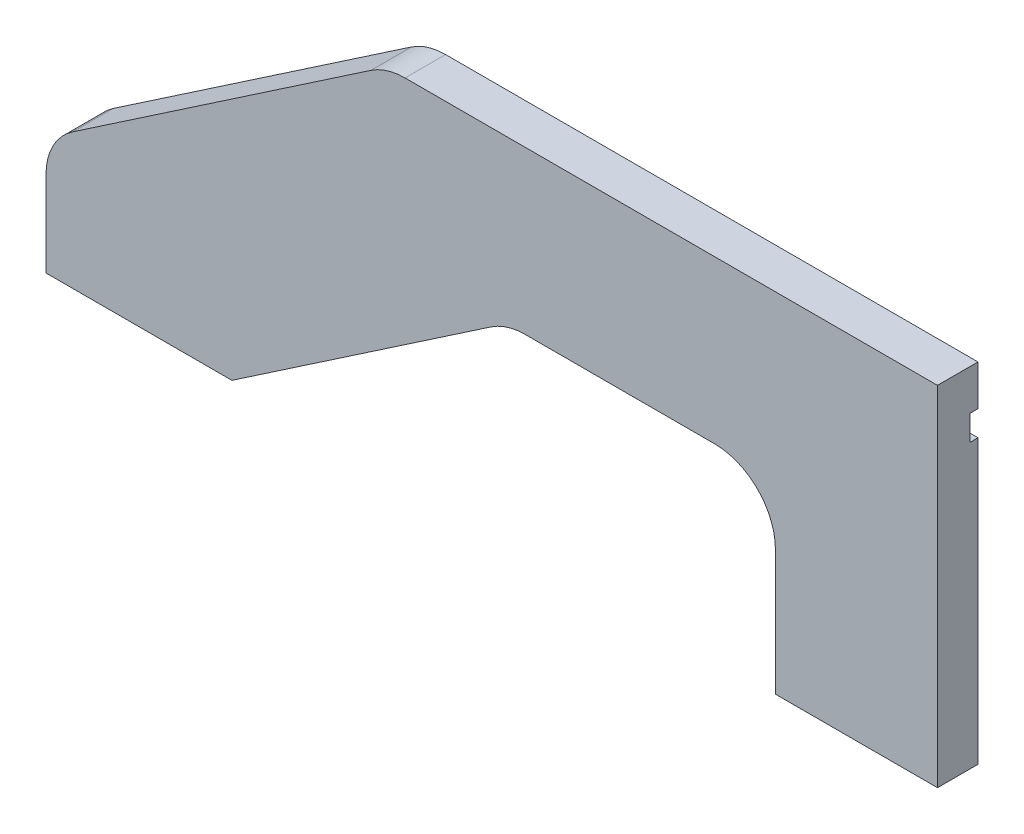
ISO-10303-21;
HEADER;
FILE_DESCRIPTION(('STEP AP214'),'2;1');
FILE_NAME('part.step','',(''),(''),'','','');
FILE_SCHEMA(('AUTOMOTIVE_DESIGN { 1 0 10303 214 1 1 1 1 }'));
ENDSEC;
DATA;
#1=APPLICATION_CONTEXT('core data for automotive mechanical design processes');
#2=APPLICATION_PROTOCOL_DEFINITION('international standard','automotive_design',2000,#1);
#3=PRODUCT_CONTEXT('',#1,'mechanical');
#4=PRODUCT('Part','Part','',(#3));
#5=PRODUCT_RELATED_PRODUCT_CATEGORY('part','',(#4));
#6=PRODUCT_DEFINITION_FORMATION('','',#4);
#7=PRODUCT_DEFINITION_CONTEXT('part definition',#1,'design');
#8=PRODUCT_DEFINITION('design','',#6,#7);
#9=PRODUCT_DEFINITION_SHAPE('','',#8);
#10=(LENGTH_UNIT() NAMED_UNIT(*) SI_UNIT(.MILLI.,.METRE.));
#11=(NAMED_UNIT(*) PLANE_ANGLE_UNIT() SI_UNIT($,.RADIAN.));
#12=(NAMED_UNIT(*) SI_UNIT($,.STERADIAN.) SOLID_ANGLE_UNIT());
#13=UNCERTAINTY_MEASURE_WITH_UNIT(LENGTH_MEASURE(1.E-05),#10,'distance_accuracy_value','');
#14=(GEOMETRIC_REPRESENTATION_CONTEXT(3) GLOBAL_UNCERTAINTY_ASSIGNED_CONTEXT((#13)) GLOBAL_UNIT_ASSIGNED_CONTEXT((#10,
#11,#12)) REPRESENTATION_CONTEXT('',''));
#15=CARTESIAN_POINT('',(0.,0.,0.));
#16=DIRECTION('',(0.,0.,1.));
#17=DIRECTION('',(1.,0.,0.));
#18=AXIS2_PLACEMENT_3D('',#15,#16,#17);
#19=CARTESIAN_POINT('',(145.537875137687,-45.3129343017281,10.));
#20=DIRECTION('',(0.,1.,0.));
#21=DIRECTION('',(-1.,0.,0.));
#22=AXIS2_PLACEMENT_3D('',#19,#20,#21);
#23=PLANE('',#22);
#24=DIRECTION('',(1.,0.,0.));
#25=VECTOR('',#24,1.);
#26=CARTESIAN_POINT('',(145.537875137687,-45.3129343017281,10.));
#27=LINE('',#26,#25);
#28=CARTESIAN_POINT('',(105.537875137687,-45.3129343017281,10.));
#29=VERTEX_POINT('',#28);
#30=CARTESIAN_POINT('',(145.537875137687,-45.3129343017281,10.));
#31=VERTEX_POINT('',#30);
#32=EDGE_CURVE('E365',#29,#31,#27,.T.);
#33=ORIENTED_EDGE('',*,*,#32,.F.);
#34=DIRECTION('',(0.,0.,-1.));
#35=VECTOR('',#34,1.);
#36=CARTESIAN_POINT('',(105.537875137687,-45.3129343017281,10.));
#37=LINE('',#36,#35);
#38=CARTESIAN_POINT('',(105.537875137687,-45.3129343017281,0.));
#39=VERTEX_POINT('',#38);
#40=EDGE_CURVE('E448',#29,#39,#37,.T.);
#41=ORIENTED_EDGE('',*,*,#40,.T.);
#42=DIRECTION('',(1.,0.,0.));
#43=VECTOR('',#42,1.);
#44=CARTESIAN_POINT('',(145.537875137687,-45.3129343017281,0.));
#45=LINE('',#44,#43);
#46=CARTESIAN_POINT('',(145.537875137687,-45.3129343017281,0.));
#47=VERTEX_POINT('',#46);
#48=EDGE_CURVE('E350',#39,#47,#45,.T.);
#49=ORIENTED_EDGE('',*,*,#48,.T.);
#50=DIRECTION('',(0.,0.,-1.));
#51=VECTOR('',#50,1.);
#52=CARTESIAN_POINT('',(145.537875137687,-45.3129343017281,10.));
#53=LINE('',#52,#51);
#54=EDGE_CURVE('E369',#31,#47,#53,.T.);
#55=ORIENTED_EDGE('',*,*,#54,.F.);
#56=EDGE_LOOP('',(#33,#41,#49,#55));
#57=FACE_BOUND('',#56,.T.);
#58=ADVANCED_FACE('F26',(#57),#23,.F.);
#59=CARTESIAN_POINT('',(145.537875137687,40.6870656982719,10.));
#60=DIRECTION('',(-1.,0.,0.));
#61=DIRECTION('',(0.,-1.,0.));
#62=AXIS2_PLACEMENT_3D('',#59,#60,#61);
#63=PLANE('',#62);
#64=DIRECTION('',(0.,-1.,0.));
#65=VECTOR('',#64,1.);
#66=CARTESIAN_POINT('',(145.537875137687,30.6870656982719,2.));
#67=LINE('',#66,#65);
#68=CARTESIAN_POINT('',(145.537875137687,30.6870656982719,2.));
#69=VERTEX_POINT('',#68);
#70=CARTESIAN_POINT('',(145.537875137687,24.4870656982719,2.));
#71=VERTEX_POINT('',#70);
#72=EDGE_CURVE('E330',#69,#71,#67,.T.);
#73=ORIENTED_EDGE('',*,*,#72,.F.);
#74=DIRECTION('',(0.,0.,-1.));
#75=VECTOR('',#74,1.);
#76=CARTESIAN_POINT('',(145.537875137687,30.6870656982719,2.));
#77=LINE('',#76,#75);
#78=CARTESIAN_POINT('',(145.537875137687,30.6870656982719,0.));
#79=VERTEX_POINT('',#78);
#80=EDGE_CURVE('E334',#69,#79,#77,.T.);
#81=ORIENTED_EDGE('',*,*,#80,.T.);
#82=DIRECTION('',(0.,1.,0.));
#83=VECTOR('',#82,1.);
#84=CARTESIAN_POINT('',(145.537875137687,40.6870656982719,0.));
#85=LINE('',#84,#83);
#86=CARTESIAN_POINT('',(145.537875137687,40.6870656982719,0.));
#87=VERTEX_POINT('',#86);
#88=EDGE_CURVE('E337',#79,#87,#85,.T.);
#89=ORIENTED_EDGE('',*,*,#88,.T.);
#90=DIRECTION('',(0.,0.,-1.));
#91=VECTOR('',#90,1.);
#92=CARTESIAN_POINT('',(145.537875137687,40.6870656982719,10.));
#93=LINE('',#92,#91);
#94=CARTESIAN_POINT('',(145.537875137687,40.6870656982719,10.));
#95=VERTEX_POINT('',#94);
#96=EDGE_CURVE('E375',#95,#87,#93,.T.);
#97=ORIENTED_EDGE('',*,*,#96,.F.);
#98=DIRECTION('',(0.,1.,0.));
#99=VECTOR('',#98,1.);
#100=CARTESIAN_POINT('',(145.537875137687,40.6870656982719,10.));
#101=LINE('',#100,#99);
#102=EDGE_CURVE('E354',#31,#95,#101,.T.);
#103=ORIENTED_EDGE('',*,*,#102,.F.);
#104=ORIENTED_EDGE('',*,*,#54,.T.);
#105=CARTESIAN_POINT('',(145.537875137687,24.4870656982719,0.));
#106=VERTEX_POINT('',#105);
#107=EDGE_CURVE('E339',#47,#106,#85,.T.);
#108=ORIENTED_EDGE('',*,*,#107,.T.);
#109=DIRECTION('',(0.,0.,-1.));
#110=VECTOR('',#109,1.);
#111=CARTESIAN_POINT('',(145.537875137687,24.4870656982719,2.));
#112=LINE('',#111,#110);
#113=EDGE_CURVE('E328',#71,#106,#112,.T.);
#114=ORIENTED_EDGE('',*,*,#113,.F.);
#115=EDGE_LOOP('',(#73,#81,#89,#97,#103,#104,#108,#114));
#116=FACE_BOUND('',#115,.T.);
#117=ADVANCED_FACE('F28',(#116),#63,.F.);
#118=CARTESIAN_POINT('',(9.53787513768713,40.6870656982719,10.));
#119=DIRECTION('',(0.,-1.,0.));
#120=DIRECTION('',(1.,0.,0.));
#121=AXIS2_PLACEMENT_3D('',#118,#119,#120);
#122=PLANE('',#121);
#123=DIRECTION('',(-1.,0.,0.));
#124=VECTOR('',#123,1.);
#125=CARTESIAN_POINT('',(9.53787513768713,40.6870656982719,0.));
#126=LINE('',#125,#124);
#127=CARTESIAN_POINT('',(14.1467467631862,40.6870656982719,0.));
#128=VERTEX_POINT('',#127);
#129=EDGE_CURVE('E342',#87,#128,#126,.T.);
#130=ORIENTED_EDGE('',*,*,#129,.T.);
#131=DIRECTION('',(0.,0.,-1.));
#132=VECTOR('',#131,1.);
#133=CARTESIAN_POINT('',(14.1467467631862,40.6870656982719,10.));
#134=LINE('',#133,#132);
#135=CARTESIAN_POINT('',(14.1467467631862,40.6870656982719,10.));
#136=VERTEX_POINT('',#135);
#137=EDGE_CURVE('E404',#128,#136,#134,.F.);
#138=ORIENTED_EDGE('',*,*,#137,.T.);
#139=DIRECTION('',(-1.,0.,0.));
#140=VECTOR('',#139,1.);
#141=CARTESIAN_POINT('',(9.53787513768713,40.6870656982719,10.));
#142=LINE('',#141,#140);
#143=EDGE_CURVE('E357',#95,#136,#142,.T.);
#144=ORIENTED_EDGE('',*,*,#143,.F.);
#145=ORIENTED_EDGE('',*,*,#96,.T.);
#146=EDGE_LOOP('',(#130,#138,#144,#145));
#147=FACE_BOUND('',#146,.T.);
#148=ADVANCED_FACE('F688',(#147),#122,.F.);
#149=CARTESIAN_POINT('',(-74.4621248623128,-16.3135883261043,10.));
#150=DIRECTION('',(0.561505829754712,-0.827472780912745,0.));
#151=DIRECTION('',(0.827472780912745,0.561505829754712,0.));
#152=AXIS2_PLACEMENT_3D('',#149,#150,#151);
#153=PLANE('',#152);
#154=DIRECTION('',(-0.827472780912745,-0.561505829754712,0.));
#155=VECTOR('',#154,1.);
#156=CARTESIAN_POINT('',(-74.4621248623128,-16.3135883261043,0.));
#157=LINE('',#156,#155);
#158=CARTESIAN_POINT('',(5.72415931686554,38.0991574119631,0.));
#159=VERTEX_POINT('',#158);
#160=CARTESIAN_POINT('',(-67.8847123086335,-11.8502928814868,0.));
#161=VERTEX_POINT('',#160);
#162=EDGE_CURVE('E345',#159,#161,#157,.T.);
#163=ORIENTED_EDGE('',*,*,#162,.T.);
#164=DIRECTION('',(0.,0.,-1.));
#165=VECTOR('',#164,1.);
#166=CARTESIAN_POINT('',(-67.8847123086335,-11.8502928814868,10.));
#167=LINE('',#166,#165);
#168=CARTESIAN_POINT('',(-67.8847123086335,-11.8502928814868,10.));
#169=VERTEX_POINT('',#168);
#170=EDGE_CURVE('E398',#161,#169,#167,.F.);
#171=ORIENTED_EDGE('',*,*,#170,.T.);
#172=DIRECTION('',(-0.827472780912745,-0.561505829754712,0.));
#173=VECTOR('',#172,1.);
#174=CARTESIAN_POINT('',(-74.4621248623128,-16.3135883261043,10.));
#175=LINE('',#174,#173);
#176=CARTESIAN_POINT('',(5.72415931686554,38.0991574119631,10.));
#177=VERTEX_POINT('',#176);
#178=EDGE_CURVE('E360',#177,#169,#175,.T.);
#179=ORIENTED_EDGE('',*,*,#178,.F.);
#180=DIRECTION('',(0.,0.,-1.));
#181=VECTOR('',#180,1.);
#182=CARTESIAN_POINT('',(5.72415931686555,38.0991574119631,10.));
#183=LINE('',#182,#181);
#184=EDGE_CURVE('E395',#177,#159,#183,.T.);
#185=ORIENTED_EDGE('',*,*,#184,.T.);
#186=EDGE_LOOP('',(#163,#171,#179,#185));
#187=FACE_BOUND('',#186,.T.);
#188=ADVANCED_FACE('F698',(#187),#153,.F.);
#189=CARTESIAN_POINT('',(-74.4621248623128,-45.3129343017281,10.));
#190=DIRECTION('',(1.,0.,0.));
#191=DIRECTION('',(0.,0.,-1.));
#192=AXIS2_PLACEMENT_3D('',#189,#190,#191);
#193=PLANE('',#192);
#194=DIRECTION('',(0.,-1.,0.));
#195=VECTOR('',#194,1.);
#196=CARTESIAN_POINT('',(-74.4621248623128,-45.3129343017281,10.));
#197=LINE('',#196,#195);
#198=CARTESIAN_POINT('',(-74.4621248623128,-24.262384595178,10.));
#199=VERTEX_POINT('',#198);
#200=CARTESIAN_POINT('',(-74.4621248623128,-45.3129343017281,10.));
#201=VERTEX_POINT('',#200);
#202=EDGE_CURVE('E363',#199,#201,#197,.T.);
#203=ORIENTED_EDGE('',*,*,#202,.F.);
#204=DIRECTION('',(0.,0.,-1.));
#205=VECTOR('',#204,1.);
#206=CARTESIAN_POINT('',(-74.4621248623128,-24.262384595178,10.));
#207=LINE('',#206,#205);
#208=CARTESIAN_POINT('',(-74.4621248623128,-24.262384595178,0.));
#209=VERTEX_POINT('',#208);
#210=EDGE_CURVE('E388',#199,#209,#207,.T.);
#211=ORIENTED_EDGE('',*,*,#210,.T.);
#212=DIRECTION('',(0.,-1.,0.));
#213=VECTOR('',#212,1.);
#214=CARTESIAN_POINT('',(-74.4621248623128,-45.3129343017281,0.));
#215=LINE('',#214,#213);
#216=CARTESIAN_POINT('',(-74.4621248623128,-45.3129343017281,0.));
#217=VERTEX_POINT('',#216);
#218=EDGE_CURVE('E348',#209,#217,#215,.T.);
#219=ORIENTED_EDGE('',*,*,#218,.T.);
#220=DIRECTION('',(0.,0.,-1.));
#221=VECTOR('',#220,1.);
#222=CARTESIAN_POINT('',(-74.4621248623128,-45.3129343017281,10.));
#223=LINE('',#222,#221);
#224=EDGE_CURVE('E372',#201,#217,#223,.T.);
#225=ORIENTED_EDGE('',*,*,#224,.F.);
#226=EDGE_LOOP('',(#203,#211,#219,#225));
#227=FACE_BOUND('',#226,.T.);
#228=ADVANCED_FACE('F691',(#227),#193,.F.);
#229=CARTESIAN_POINT('',(-28.5876911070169,-45.3129343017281,0.));
#230=VERTEX_POINT('',#229);
#231=EDGE_CURVE('E351',#217,#230,#45,.T.);
#232=ORIENTED_EDGE('',*,*,#231,.T.);
#233=DIRECTION('',(0.,0.,-1.));
#234=VECTOR('',#233,1.);
#235=CARTESIAN_POINT('',(-28.587691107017,-45.3129343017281,10.));
#236=LINE('',#235,#234);
#237=CARTESIAN_POINT('',(-28.587691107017,-45.3129343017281,10.));
#238=VERTEX_POINT('',#237);
#239=EDGE_CURVE('E426',#238,#230,#236,.T.);
#240=ORIENTED_EDGE('',*,*,#239,.F.);
#241=EDGE_CURVE('E366',#201,#238,#27,.T.);
#242=ORIENTED_EDGE('',*,*,#241,.F.);
#243=ORIENTED_EDGE('',*,*,#224,.T.);
#244=EDGE_LOOP('',(#232,#240,#242,#243));
#245=FACE_BOUND('',#244,.T.);
#246=ADVANCED_FACE('F683',(#245),#23,.F.);
#247=CARTESIAN_POINT('',(145.537875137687,-45.3129343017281,10.));
#248=DIRECTION('',(0.,0.,-1.));
#249=DIRECTION('',(-1.,0.,0.));
#250=AXIS2_PLACEMENT_3D('',#247,#248,#249);
#251=PLANE('',#250);
#252=ORIENTED_EDGE('',*,*,#178,.T.);
#253=CARTESIAN_POINT('',(-59.4621248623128,-24.262384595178,10.));
#254=DIRECTION('',(0.,0.,-1.));
#255=DIRECTION('',(-1.,0.,0.));
#256=AXIS2_PLACEMENT_3D('',#253,#254,#255);
#257=CIRCLE('',#256,15.);
#258=EDGE_CURVE('E402',#169,#199,#257,.F.);
#259=ORIENTED_EDGE('',*,*,#258,.T.);
#260=ORIENTED_EDGE('',*,*,#202,.T.);
#261=ORIENTED_EDGE('',*,*,#241,.T.);
#262=DIRECTION('',(0.827472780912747,0.561505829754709,0.));
#263=VECTOR('',#262,1.);
#264=CARTESIAN_POINT('',(39.2010047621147,0.687065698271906,10.));
#265=LINE('',#264,#263);
#266=CARTESIAN_POINT('',(35.3872889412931,-1.90084258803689,10.));
#267=VERTEX_POINT('',#266);
#268=EDGE_CURVE('E437',#238,#267,#265,.T.);
#269=ORIENTED_EDGE('',*,*,#268,.T.);
#270=CARTESIAN_POINT('',(43.8098763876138,-14.3129343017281,10.));
#271=DIRECTION('',(0.,0.,-1.));
#272=DIRECTION('',(-1.,0.,0.));
#273=AXIS2_PLACEMENT_3D('',#270,#271,#272);
#274=CIRCLE('',#273,15.);
#275=CARTESIAN_POINT('',(43.8098763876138,0.687065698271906,10.));
#276=VERTEX_POINT('',#275);
#277=EDGE_CURVE('E11',#267,#276,#274,.T.);
#278=ORIENTED_EDGE('',*,*,#277,.T.);
#279=DIRECTION('',(1.,0.,0.));
#280=VECTOR('',#279,1.);
#281=CARTESIAN_POINT('',(105.537875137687,0.687065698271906,10.));
#282=LINE('',#281,#280);
#283=CARTESIAN_POINT('',(90.5378751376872,0.687065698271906,10.));
#284=VERTEX_POINT('',#283);
#285=EDGE_CURVE('E435',#276,#284,#282,.T.);
#286=ORIENTED_EDGE('',*,*,#285,.T.);
#287=CARTESIAN_POINT('',(90.5378751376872,-14.3129343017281,10.));
#288=DIRECTION('',(0.,0.,-1.));
#289=DIRECTION('',(-1.,0.,0.));
#290=AXIS2_PLACEMENT_3D('',#287,#288,#289);
#291=CIRCLE('',#290,15.);
#292=CARTESIAN_POINT('',(105.537875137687,-14.3129343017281,10.));
#293=VERTEX_POINT('',#292);
#294=EDGE_CURVE('E408',#284,#293,#291,.T.);
#295=ORIENTED_EDGE('',*,*,#294,.T.);
#296=DIRECTION('',(0.,-1.,0.));
#297=VECTOR('',#296,1.);
#298=CARTESIAN_POINT('',(105.537875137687,-45.3129343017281,10.));
#299=LINE('',#298,#297);
#300=EDGE_CURVE('E441',#293,#29,#299,.T.);
#301=ORIENTED_EDGE('',*,*,#300,.T.);
#302=ORIENTED_EDGE('',*,*,#32,.T.);
#303=ORIENTED_EDGE('',*,*,#102,.T.);
#304=ORIENTED_EDGE('',*,*,#143,.T.);
#305=CARTESIAN_POINT('',(14.1467467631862,25.6870656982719,10.));
#306=DIRECTION('',(0.,0.,-1.));
#307=DIRECTION('',(-1.,0.,0.));
#308=AXIS2_PLACEMENT_3D('',#305,#306,#307);
#309=CIRCLE('',#308,15.);
#310=EDGE_CURVE('E400',#136,#177,#309,.F.);
#311=ORIENTED_EDGE('',*,*,#310,.T.);
#312=EDGE_LOOP('',(#252,#259,#260,#261,#269,#278,#286,#295,#301,#302,#303,#304,#311));
#313=FACE_BOUND('',#312,.T.);
#314=ADVANCED_FACE('F434',(#313),#251,.F.);
#315=CARTESIAN_POINT('',(145.537875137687,-45.3129343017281,0.));
#316=DIRECTION('',(0.,0.,-1.));
#317=DIRECTION('',(-1.,0.,0.));
#318=AXIS2_PLACEMENT_3D('',#315,#316,#317);
#319=PLANE('',#318);
#320=CARTESIAN_POINT('',(20.6378751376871,25.5870656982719,0.));
#321=DIRECTION('',(0.,0.,-1.));
#322=DIRECTION('',(-1.,0.,0.));
#323=AXIS2_PLACEMENT_3D('',#320,#321,#322);
#324=CIRCLE('',#323,1.6);
#325=CARTESIAN_POINT('',(21.7997701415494,24.4870656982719,0.));
#326=VERTEX_POINT('',#325);
#327=CARTESIAN_POINT('',(19.5378751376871,26.7489607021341,0.));
#328=VERTEX_POINT('',#327);
#329=EDGE_CURVE('E306',#326,#328,#324,.T.);
#330=ORIENTED_EDGE('',*,*,#329,.F.);
#331=DIRECTION('',(-1.,0.,0.));
#332=VECTOR('',#331,1.);
#333=CARTESIAN_POINT('',(145.537875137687,24.4870656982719,0.));
#334=LINE('',#333,#332);
#335=EDGE_CURVE('E505',#106,#326,#334,.T.);
#336=ORIENTED_EDGE('',*,*,#335,.F.);
#337=ORIENTED_EDGE('',*,*,#107,.F.);
#338=ORIENTED_EDGE('',*,*,#48,.F.);
#339=DIRECTION('',(0.,-1.,0.));
#340=VECTOR('',#339,1.);
#341=CARTESIAN_POINT('',(105.537875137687,-45.3129343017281,0.));
#342=LINE('',#341,#340);
#343=CARTESIAN_POINT('',(105.537875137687,-14.3129343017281,0.));
#344=VERTEX_POINT('',#343);
#345=EDGE_CURVE('E444',#344,#39,#342,.T.);
#346=ORIENTED_EDGE('',*,*,#345,.F.);
#347=CARTESIAN_POINT('',(90.5378751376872,-14.3129343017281,0.));
#348=DIRECTION('',(0.,0.,-1.));
#349=DIRECTION('',(-1.,0.,0.));
#350=AXIS2_PLACEMENT_3D('',#347,#348,#349);
#351=CIRCLE('',#350,15.);
#352=CARTESIAN_POINT('',(90.5378751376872,0.687065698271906,0.));
#353=VERTEX_POINT('',#352);
#354=EDGE_CURVE('E406',#344,#353,#351,.F.);
#355=ORIENTED_EDGE('',*,*,#354,.T.);
#356=DIRECTION('',(1.,0.,0.));
#357=VECTOR('',#356,1.);
#358=CARTESIAN_POINT('',(105.537875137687,0.687065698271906,0.));
#359=LINE('',#358,#357);
#360=CARTESIAN_POINT('',(43.8098763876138,0.687065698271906,0.));
#361=VERTEX_POINT('',#360);
#362=EDGE_CURVE('E418',#361,#353,#359,.T.);
#363=ORIENTED_EDGE('',*,*,#362,.F.);
#364=CARTESIAN_POINT('',(43.8098763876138,-14.3129343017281,0.));
#365=DIRECTION('',(0.,0.,-1.));
#366=DIRECTION('',(-1.,0.,0.));
#367=AXIS2_PLACEMENT_3D('',#364,#365,#366);
#368=CIRCLE('',#367,15.);
#369=CARTESIAN_POINT('',(35.3872889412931,-1.90084258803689,0.));
#370=VERTEX_POINT('',#369);
#371=EDGE_CURVE('E34',#361,#370,#368,.F.);
#372=ORIENTED_EDGE('',*,*,#371,.T.);
#373=DIRECTION('',(0.827472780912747,0.561505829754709,0.));
#374=VECTOR('',#373,1.);
#375=CARTESIAN_POINT('',(39.2010047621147,0.687065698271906,0.));
#376=LINE('',#375,#374);
#377=EDGE_CURVE('E416',#230,#370,#376,.T.);
#378=ORIENTED_EDGE('',*,*,#377,.F.);
#379=ORIENTED_EDGE('',*,*,#231,.F.);
#380=ORIENTED_EDGE('',*,*,#218,.F.);
#381=CARTESIAN_POINT('',(-59.4621248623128,-24.262384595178,0.));
#382=DIRECTION('',(0.,0.,-1.));
#383=DIRECTION('',(-1.,0.,0.));
#384=AXIS2_PLACEMENT_3D('',#381,#382,#383);
#385=CIRCLE('',#384,15.);
#386=EDGE_CURVE('E393',#209,#161,#385,.T.);
#387=ORIENTED_EDGE('',*,*,#386,.T.);
#388=ORIENTED_EDGE('',*,*,#162,.F.);
#389=CARTESIAN_POINT('',(14.1467467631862,25.6870656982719,0.));
#390=DIRECTION('',(0.,0.,-1.));
#391=DIRECTION('',(-1.,0.,0.));
#392=AXIS2_PLACEMENT_3D('',#389,#390,#391);
#393=CIRCLE('',#392,15.);
#394=EDGE_CURVE('E391',#159,#128,#393,.T.);
#395=ORIENTED_EDGE('',*,*,#394,.T.);
#396=ORIENTED_EDGE('',*,*,#129,.F.);
#397=ORIENTED_EDGE('',*,*,#88,.F.);
#398=DIRECTION('',(1.,0.,0.));
#399=VECTOR('',#398,1.);
#400=CARTESIAN_POINT('',(145.537875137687,30.6870656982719,0.));
#401=LINE('',#400,#399);
#402=CARTESIAN_POINT('',(21.7997701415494,30.6870656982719,0.));
#403=VERTEX_POINT('',#402);
#404=EDGE_CURVE('E510',#403,#79,#401,.T.);
#405=ORIENTED_EDGE('',*,*,#404,.F.);
#406=CARTESIAN_POINT('',(20.6378751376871,29.5870656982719,0.));
#407=DIRECTION('',(0.,0.,-1.));
#408=DIRECTION('',(-1.,0.,0.));
#409=AXIS2_PLACEMENT_3D('',#406,#407,#408);
#410=CIRCLE('',#409,1.6);
#411=CARTESIAN_POINT('',(19.5378751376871,28.4251706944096,0.));
#412=VERTEX_POINT('',#411);
#413=EDGE_CURVE('E310',#412,#403,#410,.T.);
#414=ORIENTED_EDGE('',*,*,#413,.F.);
#415=DIRECTION('',(0.,1.,0.));
#416=VECTOR('',#415,1.);
#417=CARTESIAN_POINT('',(19.5378751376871,30.6870656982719,0.));
#418=LINE('',#417,#416);
#419=EDGE_CURVE('E508',#328,#412,#418,.T.);
#420=ORIENTED_EDGE('',*,*,#419,.F.);
#421=EDGE_LOOP('',(#330,#336,#337,#338,#346,#355,#363,#372,#378,#379,#380,#387,#388,#395,#396,
#397,#405,#414,#420));
#422=FACE_BOUND('',#421,.T.);
#423=CARTESIAN_POINT('',(20.4378751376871,10.5870656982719,0.));
#424=DIRECTION('',(0.,0.,-1.));
#425=DIRECTION('',(1.,0.,0.));
#426=AXIS2_PLACEMENT_3D('',#423,#424,#425);
#427=CIRCLE('',#426,1.6);
#428=CARTESIAN_POINT('',(19.2759801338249,11.6870656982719,0.));
#429=VERTEX_POINT('',#428);
#430=CARTESIAN_POINT('',(21.5378751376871,9.42517069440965,0.));
#431=VERTEX_POINT('',#430);
#432=EDGE_CURVE('E532',#429,#431,#427,.T.);
#433=ORIENTED_EDGE('',*,*,#432,.F.);
#434=DIRECTION('',(1.,0.,0.));
#435=VECTOR('',#434,1.);
#436=CARTESIAN_POINT('',(-8.46212486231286,11.6870656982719,0.));
#437=LINE('',#436,#435);
#438=CARTESIAN_POINT('',(-6.20022985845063,11.6870656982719,0.));
#439=VERTEX_POINT('',#438);
#440=EDGE_CURVE('E490',#439,#429,#437,.T.);
#441=ORIENTED_EDGE('',*,*,#440,.F.);
#442=CARTESIAN_POINT('',(-7.36212486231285,10.5870656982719,0.));
#443=DIRECTION('',(0.,0.,-1.));
#444=DIRECTION('',(-1.,0.,0.));
#445=AXIS2_PLACEMENT_3D('',#442,#443,#444);
#446=CIRCLE('',#445,1.6);
#447=CARTESIAN_POINT('',(-8.46212486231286,9.42517069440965,0.));
#448=VERTEX_POINT('',#447);
#449=EDGE_CURVE('E565',#448,#439,#446,.T.);
#450=ORIENTED_EDGE('',*,*,#449,.F.);
#451=DIRECTION('',(0.,1.,0.));
#452=VECTOR('',#451,1.);
#453=CARTESIAN_POINT('',(-8.46212486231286,5.48706569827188,0.));
#454=LINE('',#453,#452);
#455=CARTESIAN_POINT('',(-8.46212486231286,7.7489607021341,0.));
#456=VERTEX_POINT('',#455);
#457=EDGE_CURVE('E488',#456,#448,#454,.T.);
#458=ORIENTED_EDGE('',*,*,#457,.F.);
#459=CARTESIAN_POINT('',(-7.36212486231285,6.58706569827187,0.));
#460=DIRECTION('',(0.,0.,-1.));
#461=DIRECTION('',(-1.,0.,0.));
#462=AXIS2_PLACEMENT_3D('',#459,#460,#461);
#463=CIRCLE('',#462,1.6);
#464=CARTESIAN_POINT('',(-6.20022985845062,5.48706569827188,0.));
#465=VERTEX_POINT('',#464);
#466=EDGE_CURVE('E554',#465,#456,#463,.T.);
#467=ORIENTED_EDGE('',*,*,#466,.F.);
#468=DIRECTION('',(-1.,0.,0.));
#469=VECTOR('',#468,1.);
#470=CARTESIAN_POINT('',(-8.46212486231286,5.48706569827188,0.));
#471=LINE('',#470,#469);
#472=CARTESIAN_POINT('',(19.2759801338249,5.48706569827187,0.));
#473=VERTEX_POINT('',#472);
#474=EDGE_CURVE('E495',#473,#465,#471,.T.);
#475=ORIENTED_EDGE('',*,*,#474,.F.);
#476=CARTESIAN_POINT('',(20.4378751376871,6.58706569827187,0.));
#477=DIRECTION('',(0.,0.,-1.));
#478=DIRECTION('',(1.,0.,0.));
#479=AXIS2_PLACEMENT_3D('',#476,#477,#478);
#480=CIRCLE('',#479,1.6);
#481=CARTESIAN_POINT('',(21.5378751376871,7.7489607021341,0.));
#482=VERTEX_POINT('',#481);
#483=EDGE_CURVE('E543',#482,#473,#480,.T.);
#484=ORIENTED_EDGE('',*,*,#483,.F.);
#485=DIRECTION('',(0.,-1.,0.));
#486=VECTOR('',#485,1.);
#487=CARTESIAN_POINT('',(21.5378751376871,5.48706569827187,0.));
#488=LINE('',#487,#486);
#489=EDGE_CURVE('E493',#431,#482,#488,.T.);
#490=ORIENTED_EDGE('',*,*,#489,.F.);
#491=EDGE_LOOP('',(#433,#441,#450,#458,#467,#475,#484,#490));
#492=FACE_BOUND('',#491,.T.);
#493=CARTESIAN_POINT('',(-7.56212486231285,-8.41293430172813,0.));
#494=DIRECTION('',(0.,0.,-1.));
#495=DIRECTION('',(1.,0.,0.));
#496=AXIS2_PLACEMENT_3D('',#493,#494,#495);
#497=CIRCLE('',#496,1.6);
#498=CARTESIAN_POINT('',(-8.72401986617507,-7.31293430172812,0.));
#499=VERTEX_POINT('',#498);
#500=CARTESIAN_POINT('',(-6.46212486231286,-9.57482930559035,0.));
#501=VERTEX_POINT('',#500);
#502=EDGE_CURVE('E574',#499,#501,#497,.T.);
#503=ORIENTED_EDGE('',*,*,#502,.F.);
#504=DIRECTION('',(1.,0.,0.));
#505=VECTOR('',#504,1.);
#506=CARTESIAN_POINT('',(-6.46212486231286,-7.31293430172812,0.));
#507=LINE('',#506,#505);
#508=CARTESIAN_POINT('',(-34.2002298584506,-7.31293430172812,0.));
#509=VERTEX_POINT('',#508);
#510=EDGE_CURVE('E476',#509,#499,#507,.T.);
#511=ORIENTED_EDGE('',*,*,#510,.F.);
#512=CARTESIAN_POINT('',(-35.3621248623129,-8.41293430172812,0.));
#513=DIRECTION('',(0.,0.,-1.));
#514=DIRECTION('',(-1.,0.,0.));
#515=AXIS2_PLACEMENT_3D('',#512,#513,#514);
#516=CIRCLE('',#515,1.6);
#517=CARTESIAN_POINT('',(-36.4621248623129,-9.57482930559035,0.));
#518=VERTEX_POINT('',#517);
#519=EDGE_CURVE('E605',#518,#509,#516,.T.);
#520=ORIENTED_EDGE('',*,*,#519,.F.);
#521=DIRECTION('',(0.,1.,0.));
#522=VECTOR('',#521,1.);
#523=CARTESIAN_POINT('',(-36.4621248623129,-7.31293430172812,0.));
#524=LINE('',#523,#522);
#525=CARTESIAN_POINT('',(-36.4621248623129,-11.2510392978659,0.));
#526=VERTEX_POINT('',#525);
#527=EDGE_CURVE('E474',#526,#518,#524,.T.);
#528=ORIENTED_EDGE('',*,*,#527,.F.);
#529=CARTESIAN_POINT('',(-35.3621248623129,-12.4129343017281,0.));
#530=DIRECTION('',(0.,0.,-1.));
#531=DIRECTION('',(-1.,0.,0.));
#532=AXIS2_PLACEMENT_3D('',#529,#530,#531);
#533=CIRCLE('',#532,1.6);
#534=CARTESIAN_POINT('',(-34.2002298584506,-13.5129343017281,0.));
#535=VERTEX_POINT('',#534);
#536=EDGE_CURVE('E594',#535,#526,#533,.T.);
#537=ORIENTED_EDGE('',*,*,#536,.F.);
#538=DIRECTION('',(-1.,0.,0.));
#539=VECTOR('',#538,1.);
#540=CARTESIAN_POINT('',(-6.46212486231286,-13.5129343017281,0.));
#541=LINE('',#540,#539);
#542=CARTESIAN_POINT('',(-8.72401986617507,-13.5129343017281,0.));
#543=VERTEX_POINT('',#542);
#544=EDGE_CURVE('E472',#543,#535,#541,.T.);
#545=ORIENTED_EDGE('',*,*,#544,.F.);
#546=CARTESIAN_POINT('',(-7.56212486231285,-12.4129343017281,0.));
#547=DIRECTION('',(0.,0.,-1.));
#548=DIRECTION('',(1.,0.,0.));
#549=AXIS2_PLACEMENT_3D('',#546,#547,#548);
#550=CIRCLE('',#549,1.6);
#551=CARTESIAN_POINT('',(-6.46212486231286,-11.2510392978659,0.));
#552=VERTEX_POINT('',#551);
#553=EDGE_CURVE('E585',#552,#543,#550,.T.);
#554=ORIENTED_EDGE('',*,*,#553,.F.);
#555=DIRECTION('',(0.,-1.,0.));
#556=VECTOR('',#555,1.);
#557=CARTESIAN_POINT('',(-6.46212486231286,-7.31293430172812,0.));
#558=LINE('',#557,#556);
#559=EDGE_CURVE('E470',#501,#552,#558,.T.);
#560=ORIENTED_EDGE('',*,*,#559,.F.);
#561=EDGE_LOOP('',(#503,#511,#520,#528,#537,#545,#554,#560));
#562=FACE_BOUND('',#561,.T.);
#563=CARTESIAN_POINT('',(-35.5621248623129,-27.4129343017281,0.));
#564=DIRECTION('',(0.,0.,-1.));
#565=DIRECTION('',(1.,0.,0.));
#566=AXIS2_PLACEMENT_3D('',#563,#564,#565);
#567=CIRCLE('',#566,1.6);
#568=CARTESIAN_POINT('',(-36.7240198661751,-26.3129343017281,0.));
#569=VERTEX_POINT('',#568);
#570=CARTESIAN_POINT('',(-34.4621248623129,-28.5748293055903,0.));
#571=VERTEX_POINT('',#570);
#572=EDGE_CURVE('E616',#569,#571,#567,.T.);
#573=ORIENTED_EDGE('',*,*,#572,.F.);
#574=DIRECTION('',(1.,0.,0.));
#575=VECTOR('',#574,1.);
#576=CARTESIAN_POINT('',(-34.4621248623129,-26.3129343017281,0.));
#577=LINE('',#576,#575);
#578=CARTESIAN_POINT('',(-62.2002298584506,-26.3129343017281,0.));
#579=VERTEX_POINT('',#578);
#580=EDGE_CURVE('E458',#579,#569,#577,.T.);
#581=ORIENTED_EDGE('',*,*,#580,.F.);
#582=CARTESIAN_POINT('',(-63.3621248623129,-27.4129343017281,0.));
#583=DIRECTION('',(0.,0.,-1.));
#584=DIRECTION('',(-1.,0.,0.));
#585=AXIS2_PLACEMENT_3D('',#582,#583,#584);
#586=CIRCLE('',#585,1.6);
#587=CARTESIAN_POINT('',(-64.4621248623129,-28.5748293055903,0.));
#588=VERTEX_POINT('',#587);
#589=EDGE_CURVE('E648',#588,#579,#586,.T.);
#590=ORIENTED_EDGE('',*,*,#589,.F.);
#591=DIRECTION('',(0.,1.,0.));
#592=VECTOR('',#591,1.);
#593=CARTESIAN_POINT('',(-64.4621248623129,-26.3129343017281,0.));
#594=LINE('',#593,#592);
#595=CARTESIAN_POINT('',(-64.4621248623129,-30.2510392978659,0.));
#596=VERTEX_POINT('',#595);
#597=EDGE_CURVE('E456',#596,#588,#594,.T.);
#598=ORIENTED_EDGE('',*,*,#597,.F.);
#599=CARTESIAN_POINT('',(-63.3621248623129,-31.4129343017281,0.));
#600=DIRECTION('',(0.,0.,-1.));
#601=DIRECTION('',(-1.,0.,0.));
#602=AXIS2_PLACEMENT_3D('',#599,#600,#601);
#603=CIRCLE('',#602,1.6);
#604=CARTESIAN_POINT('',(-62.2002298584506,-32.5129343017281,0.));
#605=VERTEX_POINT('',#604);
#606=EDGE_CURVE('E637',#605,#596,#603,.T.);
#607=ORIENTED_EDGE('',*,*,#606,.F.);
#608=DIRECTION('',(-1.,0.,0.));
#609=VECTOR('',#608,1.);
#610=CARTESIAN_POINT('',(-34.4621248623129,-32.5129343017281,0.));
#611=LINE('',#610,#609);
#612=CARTESIAN_POINT('',(-36.7240198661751,-32.5129343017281,0.));
#613=VERTEX_POINT('',#612);
#614=EDGE_CURVE('E454',#613,#605,#611,.T.);
#615=ORIENTED_EDGE('',*,*,#614,.F.);
#616=CARTESIAN_POINT('',(-35.5621248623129,-31.4129343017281,0.));
#617=DIRECTION('',(0.,0.,-1.));
#618=DIRECTION('',(1.,0.,0.));
#619=AXIS2_PLACEMENT_3D('',#616,#617,#618);
#620=CIRCLE('',#619,1.6);
#621=CARTESIAN_POINT('',(-34.4621248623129,-30.2510392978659,0.));
#622=VERTEX_POINT('',#621);
#623=EDGE_CURVE('E627',#622,#613,#620,.T.);
#624=ORIENTED_EDGE('',*,*,#623,.F.);
#625=DIRECTION('',(0.,-1.,0.));
#626=VECTOR('',#625,1.);
#627=CARTESIAN_POINT('',(-34.4621248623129,-26.3129343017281,0.));
#628=LINE('',#627,#626);
#629=EDGE_CURVE('E451',#571,#622,#628,.T.);
#630=ORIENTED_EDGE('',*,*,#629,.F.);
#631=EDGE_LOOP('',(#573,#581,#590,#598,#607,#615,#624,#630));
#632=FACE_BOUND('',#631,.T.);
#633=ADVANCED_FACE('F413',(#422,#492,#562,#632),#319,.T.);
#634=CARTESIAN_POINT('',(145.537875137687,30.6870656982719,2.));
#635=DIRECTION('',(0.,1.,0.));
#636=DIRECTION('',(0.,0.,1.));
#637=AXIS2_PLACEMENT_3D('',#634,#635,#636);
#638=PLANE('',#637);
#639=DIRECTION('',(1.,0.,0.));
#640=VECTOR('',#639,1.);
#641=CARTESIAN_POINT('',(145.537875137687,30.6870656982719,2.));
#642=LINE('',#641,#640);
#643=CARTESIAN_POINT('',(21.7997701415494,30.6870656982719,2.));
#644=VERTEX_POINT('',#643);
#645=EDGE_CURVE('E326',#644,#69,#642,.T.);
#646=ORIENTED_EDGE('',*,*,#645,.F.);
#647=DIRECTION('',(0.,0.,-1.));
#648=VECTOR('',#647,1.);
#649=CARTESIAN_POINT('',(21.7997701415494,30.6870656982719,2.));
#650=LINE('',#649,#648);
#651=EDGE_CURVE('E529',#644,#403,#650,.T.);
#652=ORIENTED_EDGE('',*,*,#651,.T.);
#653=ORIENTED_EDGE('',*,*,#404,.T.);
#654=ORIENTED_EDGE('',*,*,#80,.F.);
#655=EDGE_LOOP('',(#646,#652,#653,#654));
#656=FACE_BOUND('',#655,.T.);
#657=ADVANCED_FACE('F721',(#656),#638,.F.);
#658=CARTESIAN_POINT('',(19.5378751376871,30.6870656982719,2.));
#659=DIRECTION('',(-1.,0.,0.));
#660=DIRECTION('',(0.,0.,1.));
#661=AXIS2_PLACEMENT_3D('',#658,#659,#660);
#662=PLANE('',#661);
#663=DIRECTION('',(0.,1.,0.));
#664=VECTOR('',#663,1.);
#665=CARTESIAN_POINT('',(19.5378751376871,30.6870656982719,2.));
#666=LINE('',#665,#664);
#667=CARTESIAN_POINT('',(19.5378751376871,26.7489607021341,2.));
#668=VERTEX_POINT('',#667);
#669=CARTESIAN_POINT('',(19.5378751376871,28.4251706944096,2.));
#670=VERTEX_POINT('',#669);
#671=EDGE_CURVE('E317',#668,#670,#666,.T.);
#672=ORIENTED_EDGE('',*,*,#671,.F.);
#673=DIRECTION('',(0.,0.,-1.));
#674=VECTOR('',#673,1.);
#675=CARTESIAN_POINT('',(19.5378751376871,26.7489607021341,2.));
#676=LINE('',#675,#674);
#677=EDGE_CURVE('E300',#668,#328,#676,.T.);
#678=ORIENTED_EDGE('',*,*,#677,.T.);
#679=ORIENTED_EDGE('',*,*,#419,.T.);
#680=DIRECTION('',(0.,0.,-1.));
#681=VECTOR('',#680,1.);
#682=CARTESIAN_POINT('',(19.5378751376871,28.4251706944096,2.));
#683=LINE('',#682,#681);
#684=EDGE_CURVE('E325',#412,#670,#683,.F.);
#685=ORIENTED_EDGE('',*,*,#684,.T.);
#686=EDGE_LOOP('',(#672,#678,#679,#685));
#687=FACE_BOUND('',#686,.T.);
#688=ADVANCED_FACE('F323',(#687),#662,.F.);
#689=CARTESIAN_POINT('',(145.537875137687,24.4870656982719,2.));
#690=DIRECTION('',(0.,-1.,0.));
#691=DIRECTION('',(0.,0.,-1.));
#692=AXIS2_PLACEMENT_3D('',#689,#690,#691);
#693=PLANE('',#692);
#694=ORIENTED_EDGE('',*,*,#335,.T.);
#695=DIRECTION('',(0.,0.,-1.));
#696=VECTOR('',#695,1.);
#697=CARTESIAN_POINT('',(21.7997701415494,24.4870656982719,2.));
#698=LINE('',#697,#696);
#699=CARTESIAN_POINT('',(21.7997701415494,24.4870656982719,2.));
#700=VERTEX_POINT('',#699);
#701=EDGE_CURVE('E311',#326,#700,#698,.F.);
#702=ORIENTED_EDGE('',*,*,#701,.T.);
#703=DIRECTION('',(-1.,0.,0.));
#704=VECTOR('',#703,1.);
#705=CARTESIAN_POINT('',(145.537875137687,24.4870656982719,2.));
#706=LINE('',#705,#704);
#707=EDGE_CURVE('E320',#71,#700,#706,.T.);
#708=ORIENTED_EDGE('',*,*,#707,.F.);
#709=ORIENTED_EDGE('',*,*,#113,.T.);
#710=EDGE_LOOP('',(#694,#702,#708,#709));
#711=FACE_BOUND('',#710,.T.);
#712=ADVANCED_FACE('F519',(#711),#693,.F.);
#713=CARTESIAN_POINT('',(145.537875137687,24.4870656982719,2.));
#714=DIRECTION('',(0.,0.,-1.));
#715=DIRECTION('',(-1.,0.,0.));
#716=AXIS2_PLACEMENT_3D('',#713,#714,#715);
#717=PLANE('',#716);
#718=CARTESIAN_POINT('',(20.6378751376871,25.5870656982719,2.));
#719=DIRECTION('',(0.,0.,-1.));
#720=DIRECTION('',(-1.,0.,0.));
#721=AXIS2_PLACEMENT_3D('',#718,#719,#720);
#722=CIRCLE('',#721,1.6);
#723=EDGE_CURVE('E303',#700,#668,#722,.T.);
#724=ORIENTED_EDGE('',*,*,#723,.T.);
#725=ORIENTED_EDGE('',*,*,#671,.T.);
#726=CARTESIAN_POINT('',(20.6378751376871,29.5870656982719,2.));
#727=DIRECTION('',(0.,0.,-1.));
#728=DIRECTION('',(-1.,0.,0.));
#729=AXIS2_PLACEMENT_3D('',#726,#727,#728);
#730=CIRCLE('',#729,1.6);
#731=EDGE_CURVE('E526',#670,#644,#730,.T.);
#732=ORIENTED_EDGE('',*,*,#731,.T.);
#733=ORIENTED_EDGE('',*,*,#645,.T.);
#734=ORIENTED_EDGE('',*,*,#72,.T.);
#735=ORIENTED_EDGE('',*,*,#707,.T.);
#736=EDGE_LOOP('',(#724,#725,#732,#733,#734,#735));
#737=FACE_BOUND('',#736,.T.);
#738=ADVANCED_FACE('F315',(#737),#717,.T.);
#739=CARTESIAN_POINT('',(-8.46212486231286,5.48706569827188,2.));
#740=DIRECTION('',(-1.,0.,0.));
#741=DIRECTION('',(0.,0.,1.));
#742=AXIS2_PLACEMENT_3D('',#739,#740,#741);
#743=PLANE('',#742);
#744=DIRECTION('',(0.,1.,0.));
#745=VECTOR('',#744,1.);
#746=CARTESIAN_POINT('',(-8.46212486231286,5.48706569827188,2.));
#747=LINE('',#746,#745);
#748=CARTESIAN_POINT('',(-8.46212486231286,7.7489607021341,2.));
#749=VERTEX_POINT('',#748);
#750=CARTESIAN_POINT('',(-8.46212486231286,9.42517069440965,2.));
#751=VERTEX_POINT('',#750);
#752=EDGE_CURVE('E497',#749,#751,#747,.T.);
#753=ORIENTED_EDGE('',*,*,#752,.F.);
#754=DIRECTION('',(0.,0.,-1.));
#755=VECTOR('',#754,1.);
#756=CARTESIAN_POINT('',(-8.46212486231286,7.7489607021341,2.));
#757=LINE('',#756,#755);
#758=EDGE_CURVE('E562',#749,#456,#757,.T.);
#759=ORIENTED_EDGE('',*,*,#758,.T.);
#760=ORIENTED_EDGE('',*,*,#457,.T.);
#761=DIRECTION('',(0.,0.,-1.));
#762=VECTOR('',#761,1.);
#763=CARTESIAN_POINT('',(-8.46212486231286,9.42517069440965,2.));
#764=LINE('',#763,#762);
#765=EDGE_CURVE('E571',#448,#751,#764,.F.);
#766=ORIENTED_EDGE('',*,*,#765,.T.);
#767=EDGE_LOOP('',(#753,#759,#760,#766));
#768=FACE_BOUND('',#767,.T.);
#769=ADVANCED_FACE('F822',(#768),#743,.F.);
#770=CARTESIAN_POINT('',(-8.46212486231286,5.48706569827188,2.));
#771=DIRECTION('',(0.,-1.,0.));
#772=DIRECTION('',(1.,0.,0.));
#773=AXIS2_PLACEMENT_3D('',#770,#771,#772);
#774=PLANE('',#773);
#775=DIRECTION('',(-1.,0.,0.));
#776=VECTOR('',#775,1.);
#777=CARTESIAN_POINT('',(-8.46212486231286,5.48706569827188,2.));
#778=LINE('',#777,#776);
#779=CARTESIAN_POINT('',(19.2759801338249,5.48706569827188,2.));
#780=VERTEX_POINT('',#779);
#781=CARTESIAN_POINT('',(-6.20022985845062,5.48706569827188,2.));
#782=VERTEX_POINT('',#781);
#783=EDGE_CURVE('E503',#780,#782,#778,.T.);
#784=ORIENTED_EDGE('',*,*,#783,.F.);
#785=DIRECTION('',(0.,0.,-1.));
#786=VECTOR('',#785,1.);
#787=CARTESIAN_POINT('',(19.2759801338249,5.48706569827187,2.));
#788=LINE('',#787,#786);
#789=EDGE_CURVE('E551',#780,#473,#788,.T.);
#790=ORIENTED_EDGE('',*,*,#789,.T.);
#791=ORIENTED_EDGE('',*,*,#474,.T.);
#792=DIRECTION('',(0.,0.,-1.));
#793=VECTOR('',#792,1.);
#794=CARTESIAN_POINT('',(-6.20022985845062,5.48706569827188,2.));
#795=LINE('',#794,#793);
#796=EDGE_CURVE('E559',#465,#782,#795,.F.);
#797=ORIENTED_EDGE('',*,*,#796,.T.);
#798=EDGE_LOOP('',(#784,#790,#791,#797));
#799=FACE_BOUND('',#798,.T.);
#800=ADVANCED_FACE('F830',(#799),#774,.F.);
#801=CARTESIAN_POINT('',(21.5378751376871,5.48706569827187,2.));
#802=DIRECTION('',(1.,0.,0.));
#803=DIRECTION('',(0.,1.,0.));
#804=AXIS2_PLACEMENT_3D('',#801,#802,#803);
#805=PLANE('',#804);
#806=DIRECTION('',(0.,-1.,0.));
#807=VECTOR('',#806,1.);
#808=CARTESIAN_POINT('',(21.5378751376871,5.48706569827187,2.));
#809=LINE('',#808,#807);
#810=CARTESIAN_POINT('',(21.5378751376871,9.42517069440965,2.));
#811=VERTEX_POINT('',#810);
#812=CARTESIAN_POINT('',(21.5378751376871,7.7489607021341,2.));
#813=VERTEX_POINT('',#812);
#814=EDGE_CURVE('E501',#811,#813,#809,.T.);
#815=ORIENTED_EDGE('',*,*,#814,.F.);
#816=DIRECTION('',(0.,0.,-1.));
#817=VECTOR('',#816,1.);
#818=CARTESIAN_POINT('',(21.5378751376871,9.42517069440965,2.));
#819=LINE('',#818,#817);
#820=EDGE_CURVE('E540',#811,#431,#819,.T.);
#821=ORIENTED_EDGE('',*,*,#820,.T.);
#822=ORIENTED_EDGE('',*,*,#489,.T.);
#823=DIRECTION('',(0.,0.,-1.));
#824=VECTOR('',#823,1.);
#825=CARTESIAN_POINT('',(21.5378751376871,7.7489607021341,2.));
#826=LINE('',#825,#824);
#827=EDGE_CURVE('E548',#482,#813,#826,.F.);
#828=ORIENTED_EDGE('',*,*,#827,.T.);
#829=EDGE_LOOP('',(#815,#821,#822,#828));
#830=FACE_BOUND('',#829,.T.);
#831=ADVANCED_FACE('F838',(#830),#805,.F.);
#832=CARTESIAN_POINT('',(-8.46212486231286,11.6870656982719,2.));
#833=DIRECTION('',(0.,1.,0.));
#834=DIRECTION('',(-1.,0.,0.));
#835=AXIS2_PLACEMENT_3D('',#832,#833,#834);
#836=PLANE('',#835);
#837=ORIENTED_EDGE('',*,*,#440,.T.);
#838=DIRECTION('',(0.,0.,-1.));
#839=VECTOR('',#838,1.);
#840=CARTESIAN_POINT('',(19.2759801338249,11.6870656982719,2.));
#841=LINE('',#840,#839);
#842=CARTESIAN_POINT('',(19.2759801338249,11.6870656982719,2.));
#843=VERTEX_POINT('',#842);
#844=EDGE_CURVE('E537',#429,#843,#841,.F.);
#845=ORIENTED_EDGE('',*,*,#844,.T.);
#846=DIRECTION('',(1.,0.,0.));
#847=VECTOR('',#846,1.);
#848=CARTESIAN_POINT('',(-8.46212486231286,11.6870656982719,2.));
#849=LINE('',#848,#847);
#850=CARTESIAN_POINT('',(-6.20022985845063,11.6870656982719,2.));
#851=VERTEX_POINT('',#850);
#852=EDGE_CURVE('E499',#851,#843,#849,.T.);
#853=ORIENTED_EDGE('',*,*,#852,.F.);
#854=DIRECTION('',(0.,0.,-1.));
#855=VECTOR('',#854,1.);
#856=CARTESIAN_POINT('',(-6.20022985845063,11.6870656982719,2.));
#857=LINE('',#856,#855);
#858=EDGE_CURVE('E568',#851,#439,#857,.T.);
#859=ORIENTED_EDGE('',*,*,#858,.T.);
#860=EDGE_LOOP('',(#837,#845,#853,#859));
#861=FACE_BOUND('',#860,.T.);
#862=ADVANCED_FACE('F846',(#861),#836,.F.);
#863=CARTESIAN_POINT('',(-8.46212486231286,11.6870656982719,2.));
#864=DIRECTION('',(0.,0.,-1.));
#865=DIRECTION('',(-1.,0.,0.));
#866=AXIS2_PLACEMENT_3D('',#863,#864,#865);
#867=PLANE('',#866);
#868=CARTESIAN_POINT('',(20.4378751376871,10.5870656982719,2.));
#869=DIRECTION('',(0.,0.,-1.));
#870=DIRECTION('',(1.,0.,0.));
#871=AXIS2_PLACEMENT_3D('',#868,#869,#870);
#872=CIRCLE('',#871,1.6);
#873=EDGE_CURVE('E534',#843,#811,#872,.T.);
#874=ORIENTED_EDGE('',*,*,#873,.T.);
#875=ORIENTED_EDGE('',*,*,#814,.T.);
#876=CARTESIAN_POINT('',(20.4378751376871,6.58706569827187,2.));
#877=DIRECTION('',(0.,0.,-1.));
#878=DIRECTION('',(1.,0.,0.));
#879=AXIS2_PLACEMENT_3D('',#876,#877,#878);
#880=CIRCLE('',#879,1.6);
#881=EDGE_CURVE('E545',#813,#780,#880,.T.);
#882=ORIENTED_EDGE('',*,*,#881,.T.);
#883=ORIENTED_EDGE('',*,*,#783,.T.);
#884=CARTESIAN_POINT('',(-7.36212486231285,6.58706569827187,2.));
#885=DIRECTION('',(0.,0.,-1.));
#886=DIRECTION('',(-1.,0.,0.));
#887=AXIS2_PLACEMENT_3D('',#884,#885,#886);
#888=CIRCLE('',#887,1.6);
#889=EDGE_CURVE('E556',#782,#749,#888,.T.);
#890=ORIENTED_EDGE('',*,*,#889,.T.);
#891=ORIENTED_EDGE('',*,*,#752,.T.);
#892=CARTESIAN_POINT('',(-7.36212486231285,10.5870656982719,2.));
#893=DIRECTION('',(0.,0.,-1.));
#894=DIRECTION('',(-1.,0.,0.));
#895=AXIS2_PLACEMENT_3D('',#892,#893,#894);
#896=CIRCLE('',#895,1.6);
#897=EDGE_CURVE('E41',#751,#851,#896,.T.);
#898=ORIENTED_EDGE('',*,*,#897,.T.);
#899=ORIENTED_EDGE('',*,*,#852,.T.);
#900=EDGE_LOOP('',(#874,#875,#882,#883,#890,#891,#898,#899));
#901=FACE_BOUND('',#900,.T.);
#902=ADVANCED_FACE('F854',(#901),#867,.T.);
#903=CARTESIAN_POINT('',(-6.46212486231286,-7.31293430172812,2.));
#904=DIRECTION('',(1.,0.,0.));
#905=DIRECTION('',(0.,1.,0.));
#906=AXIS2_PLACEMENT_3D('',#903,#904,#905);
#907=PLANE('',#906);
#908=DIRECTION('',(0.,-1.,0.));
#909=VECTOR('',#908,1.);
#910=CARTESIAN_POINT('',(-6.46212486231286,-7.31293430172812,2.));
#911=LINE('',#910,#909);
#912=CARTESIAN_POINT('',(-6.46212486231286,-9.57482930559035,2.));
#913=VERTEX_POINT('',#912);
#914=CARTESIAN_POINT('',(-6.46212486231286,-11.2510392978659,2.));
#915=VERTEX_POINT('',#914);
#916=EDGE_CURVE('E479',#913,#915,#911,.T.);
#917=ORIENTED_EDGE('',*,*,#916,.F.);
#918=DIRECTION('',(0.,0.,-1.));
#919=VECTOR('',#918,1.);
#920=CARTESIAN_POINT('',(-6.46212486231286,-9.57482930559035,2.));
#921=LINE('',#920,#919);
#922=EDGE_CURVE('E582',#913,#501,#921,.T.);
#923=ORIENTED_EDGE('',*,*,#922,.T.);
#924=ORIENTED_EDGE('',*,*,#559,.T.);
#925=DIRECTION('',(0.,0.,-1.));
#926=VECTOR('',#925,1.);
#927=CARTESIAN_POINT('',(-6.46212486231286,-11.2510392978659,2.));
#928=LINE('',#927,#926);
#929=EDGE_CURVE('E591',#552,#915,#928,.F.);
#930=ORIENTED_EDGE('',*,*,#929,.T.);
#931=EDGE_LOOP('',(#917,#923,#924,#930));
#932=FACE_BOUND('',#931,.T.);
#933=ADVANCED_FACE('F862',(#932),#907,.F.);
#934=CARTESIAN_POINT('',(-6.46212486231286,-7.31293430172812,2.));
#935=DIRECTION('',(0.,1.,0.));
#936=DIRECTION('',(0.,0.,1.));
#937=AXIS2_PLACEMENT_3D('',#934,#935,#936);
#938=PLANE('',#937);
#939=ORIENTED_EDGE('',*,*,#510,.T.);
#940=DIRECTION('',(0.,0.,-1.));
#941=VECTOR('',#940,1.);
#942=CARTESIAN_POINT('',(-8.72401986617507,-7.31293430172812,2.));
#943=LINE('',#942,#941);
#944=CARTESIAN_POINT('',(-8.72401986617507,-7.31293430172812,2.));
#945=VERTEX_POINT('',#944);
#946=EDGE_CURVE('E579',#499,#945,#943,.F.);
#947=ORIENTED_EDGE('',*,*,#946,.T.);
#948=DIRECTION('',(1.,0.,0.));
#949=VECTOR('',#948,1.);
#950=CARTESIAN_POINT('',(-6.46212486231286,-7.31293430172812,2.));
#951=LINE('',#950,#949);
#952=CARTESIAN_POINT('',(-34.2002298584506,-7.31293430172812,2.));
#953=VERTEX_POINT('',#952);
#954=EDGE_CURVE('E485',#953,#945,#951,.T.);
#955=ORIENTED_EDGE('',*,*,#954,.F.);
#956=DIRECTION('',(0.,0.,-1.));
#957=VECTOR('',#956,1.);
#958=CARTESIAN_POINT('',(-34.2002298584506,-7.31293430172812,2.));
#959=LINE('',#958,#957);
#960=EDGE_CURVE('E613',#953,#509,#959,.T.);
#961=ORIENTED_EDGE('',*,*,#960,.T.);
#962=EDGE_LOOP('',(#939,#947,#955,#961));
#963=FACE_BOUND('',#962,.T.);
#964=ADVANCED_FACE('F870',(#963),#938,.F.);
#965=CARTESIAN_POINT('',(-36.4621248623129,-7.31293430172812,2.));
#966=DIRECTION('',(-1.,0.,0.));
#967=DIRECTION('',(0.,0.,1.));
#968=AXIS2_PLACEMENT_3D('',#965,#966,#967);
#969=PLANE('',#968);
#970=DIRECTION('',(0.,1.,0.));
#971=VECTOR('',#970,1.);
#972=CARTESIAN_POINT('',(-36.4621248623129,-7.31293430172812,2.));
#973=LINE('',#972,#971);
#974=CARTESIAN_POINT('',(-36.4621248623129,-11.2510392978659,2.));
#975=VERTEX_POINT('',#974);
#976=CARTESIAN_POINT('',(-36.4621248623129,-9.57482930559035,2.));
#977=VERTEX_POINT('',#976);
#978=EDGE_CURVE('E483',#975,#977,#973,.T.);
#979=ORIENTED_EDGE('',*,*,#978,.F.);
#980=DIRECTION('',(0.,0.,-1.));
#981=VECTOR('',#980,1.);
#982=CARTESIAN_POINT('',(-36.4621248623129,-11.2510392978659,2.));
#983=LINE('',#982,#981);
#984=EDGE_CURVE('E602',#975,#526,#983,.T.);
#985=ORIENTED_EDGE('',*,*,#984,.T.);
#986=ORIENTED_EDGE('',*,*,#527,.T.);
#987=DIRECTION('',(0.,0.,-1.));
#988=VECTOR('',#987,1.);
#989=CARTESIAN_POINT('',(-36.4621248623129,-9.57482930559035,2.));
#990=LINE('',#989,#988);
#991=EDGE_CURVE('E610',#518,#977,#990,.F.);
#992=ORIENTED_EDGE('',*,*,#991,.T.);
#993=EDGE_LOOP('',(#979,#985,#986,#992));
#994=FACE_BOUND('',#993,.T.);
#995=ADVANCED_FACE('F878',(#994),#969,.F.);
#996=CARTESIAN_POINT('',(-6.46212486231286,-13.5129343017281,2.));
#997=DIRECTION('',(0.,-1.,0.));
#998=DIRECTION('',(0.,0.,-1.));
#999=AXIS2_PLACEMENT_3D('',#996,#997,#998);
#1000=PLANE('',#999);
#1001=DIRECTION('',(-1.,0.,0.));
#1002=VECTOR('',#1001,1.);
#1003=CARTESIAN_POINT('',(-6.46212486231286,-13.5129343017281,2.));
#1004=LINE('',#1003,#1002);
#1005=CARTESIAN_POINT('',(-8.72401986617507,-13.5129343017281,2.));
#1006=VERTEX_POINT('',#1005);
#1007=CARTESIAN_POINT('',(-34.2002298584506,-13.5129343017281,2.));
#1008=VERTEX_POINT('',#1007);
#1009=EDGE_CURVE('E481',#1006,#1008,#1004,.T.);
#1010=ORIENTED_EDGE('',*,*,#1009,.F.);
#1011=DIRECTION('',(0.,0.,-1.));
#1012=VECTOR('',#1011,1.);
#1013=CARTESIAN_POINT('',(-8.72401986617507,-13.5129343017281,2.));
#1014=LINE('',#1013,#1012);
#1015=EDGE_CURVE('E588',#1006,#543,#1014,.T.);
#1016=ORIENTED_EDGE('',*,*,#1015,.T.);
#1017=ORIENTED_EDGE('',*,*,#544,.T.);
#1018=DIRECTION('',(0.,0.,-1.));
#1019=VECTOR('',#1018,1.);
#1020=CARTESIAN_POINT('',(-34.2002298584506,-13.5129343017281,2.));
#1021=LINE('',#1020,#1019);
#1022=EDGE_CURVE('E599',#535,#1008,#1021,.F.);
#1023=ORIENTED_EDGE('',*,*,#1022,.T.);
#1024=EDGE_LOOP('',(#1010,#1016,#1017,#1023));
#1025=FACE_BOUND('',#1024,.T.);
#1026=ADVANCED_FACE('F886',(#1025),#1000,.F.);
#1027=CARTESIAN_POINT('',(-6.46212486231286,-13.5129343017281,2.));
#1028=DIRECTION('',(0.,0.,-1.));
#1029=DIRECTION('',(-1.,0.,0.));
#1030=AXIS2_PLACEMENT_3D('',#1027,#1028,#1029);
#1031=PLANE('',#1030);
#1032=CARTESIAN_POINT('',(-7.56212486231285,-8.41293430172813,2.));
#1033=DIRECTION('',(0.,0.,-1.));
#1034=DIRECTION('',(1.,0.,0.));
#1035=AXIS2_PLACEMENT_3D('',#1032,#1033,#1034);
#1036=CIRCLE('',#1035,1.6);
#1037=EDGE_CURVE('E576',#945,#913,#1036,.T.);
#1038=ORIENTED_EDGE('',*,*,#1037,.T.);
#1039=ORIENTED_EDGE('',*,*,#916,.T.);
#1040=CARTESIAN_POINT('',(-7.56212486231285,-12.4129343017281,2.));
#1041=DIRECTION('',(0.,0.,-1.));
#1042=DIRECTION('',(1.,0.,0.));
#1043=AXIS2_PLACEMENT_3D('',#1040,#1041,#1042);
#1044=CIRCLE('',#1043,1.6);
#1045=EDGE_CURVE('E49',#915,#1006,#1044,.T.);
#1046=ORIENTED_EDGE('',*,*,#1045,.T.);
#1047=ORIENTED_EDGE('',*,*,#1009,.T.);
#1048=CARTESIAN_POINT('',(-35.3621248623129,-12.4129343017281,2.));
#1049=DIRECTION('',(0.,0.,-1.));
#1050=DIRECTION('',(-1.,0.,0.));
#1051=AXIS2_PLACEMENT_3D('',#1048,#1049,#1050);
#1052=CIRCLE('',#1051,1.6);
#1053=EDGE_CURVE('E596',#1008,#975,#1052,.T.);
#1054=ORIENTED_EDGE('',*,*,#1053,.T.);
#1055=ORIENTED_EDGE('',*,*,#978,.T.);
#1056=CARTESIAN_POINT('',(-35.3621248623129,-8.41293430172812,2.));
#1057=DIRECTION('',(0.,0.,-1.));
#1058=DIRECTION('',(-1.,0.,0.));
#1059=AXIS2_PLACEMENT_3D('',#1056,#1057,#1058);
#1060=CIRCLE('',#1059,1.6);
#1061=EDGE_CURVE('E607',#977,#953,#1060,.T.);
#1062=ORIENTED_EDGE('',*,*,#1061,.T.);
#1063=ORIENTED_EDGE('',*,*,#954,.T.);
#1064=EDGE_LOOP('',(#1038,#1039,#1046,#1047,#1054,#1055,#1062,#1063));
#1065=FACE_BOUND('',#1064,.T.);
#1066=ADVANCED_FACE('F894',(#1065),#1031,.T.);
#1067=CARTESIAN_POINT('',(-34.4621248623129,-26.3129343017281,2.));
#1068=DIRECTION('',(1.,0.,0.));
#1069=DIRECTION('',(0.,1.,0.));
#1070=AXIS2_PLACEMENT_3D('',#1067,#1068,#1069);
#1071=PLANE('',#1070);
#1072=DIRECTION('',(0.,-1.,0.));
#1073=VECTOR('',#1072,1.);
#1074=CARTESIAN_POINT('',(-34.4621248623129,-26.3129343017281,2.));
#1075=LINE('',#1074,#1073);
#1076=CARTESIAN_POINT('',(-34.4621248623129,-28.5748293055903,2.));
#1077=VERTEX_POINT('',#1076);
#1078=CARTESIAN_POINT('',(-34.4621248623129,-30.2510392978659,2.));
#1079=VERTEX_POINT('',#1078);
#1080=EDGE_CURVE('E461',#1077,#1079,#1075,.T.);
#1081=ORIENTED_EDGE('',*,*,#1080,.F.);
#1082=DIRECTION('',(0.,0.,-1.));
#1083=VECTOR('',#1082,1.);
#1084=CARTESIAN_POINT('',(-34.4621248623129,-28.5748293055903,2.));
#1085=LINE('',#1084,#1083);
#1086=EDGE_CURVE('E624',#1077,#571,#1085,.T.);
#1087=ORIENTED_EDGE('',*,*,#1086,.T.);
#1088=ORIENTED_EDGE('',*,*,#629,.T.);
#1089=DIRECTION('',(0.,0.,-1.));
#1090=VECTOR('',#1089,1.);
#1091=CARTESIAN_POINT('',(-34.4621248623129,-30.2510392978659,2.));
#1092=LINE('',#1091,#1090);
#1093=EDGE_CURVE('E634',#622,#1079,#1092,.F.);
#1094=ORIENTED_EDGE('',*,*,#1093,.T.);
#1095=EDGE_LOOP('',(#1081,#1087,#1088,#1094));
#1096=FACE_BOUND('',#1095,.T.);
#1097=ADVANCED_FACE('F902',(#1096),#1071,.F.);
#1098=CARTESIAN_POINT('',(-34.4621248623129,-26.3129343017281,2.));
#1099=DIRECTION('',(0.,1.,0.));
#1100=DIRECTION('',(-1.,0.,0.));
#1101=AXIS2_PLACEMENT_3D('',#1098,#1099,#1100);
#1102=PLANE('',#1101);
#1103=ORIENTED_EDGE('',*,*,#580,.T.);
#1104=DIRECTION('',(0.,0.,-1.));
#1105=VECTOR('',#1104,1.);
#1106=CARTESIAN_POINT('',(-36.7240198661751,-26.3129343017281,2.));
#1107=LINE('',#1106,#1105);
#1108=CARTESIAN_POINT('',(-36.7240198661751,-26.3129343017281,2.));
#1109=VERTEX_POINT('',#1108);
#1110=EDGE_CURVE('E621',#569,#1109,#1107,.F.);
#1111=ORIENTED_EDGE('',*,*,#1110,.T.);
#1112=DIRECTION('',(1.,0.,0.));
#1113=VECTOR('',#1112,1.);
#1114=CARTESIAN_POINT('',(-34.4621248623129,-26.3129343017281,2.));
#1115=LINE('',#1114,#1113);
#1116=CARTESIAN_POINT('',(-62.2002298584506,-26.3129343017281,2.));
#1117=VERTEX_POINT('',#1116);
#1118=EDGE_CURVE('E467',#1117,#1109,#1115,.T.);
#1119=ORIENTED_EDGE('',*,*,#1118,.F.);
#1120=DIRECTION('',(0.,0.,-1.));
#1121=VECTOR('',#1120,1.);
#1122=CARTESIAN_POINT('',(-62.2002298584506,-26.3129343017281,2.));
#1123=LINE('',#1122,#1121);
#1124=EDGE_CURVE('E427',#1117,#579,#1123,.T.);
#1125=ORIENTED_EDGE('',*,*,#1124,.T.);
#1126=EDGE_LOOP('',(#1103,#1111,#1119,#1125));
#1127=FACE_BOUND('',#1126,.T.);
#1128=ADVANCED_FACE('F910',(#1127),#1102,.F.);
#1129=CARTESIAN_POINT('',(-64.4621248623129,-26.3129343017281,2.));
#1130=DIRECTION('',(-1.,0.,0.));
#1131=DIRECTION('',(0.,0.,1.));
#1132=AXIS2_PLACEMENT_3D('',#1129,#1130,#1131);
#1133=PLANE('',#1132);
#1134=DIRECTION('',(0.,1.,0.));
#1135=VECTOR('',#1134,1.);
#1136=CARTESIAN_POINT('',(-64.4621248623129,-26.3129343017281,2.));
#1137=LINE('',#1136,#1135);
#1138=CARTESIAN_POINT('',(-64.4621248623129,-30.2510392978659,2.));
#1139=VERTEX_POINT('',#1138);
#1140=CARTESIAN_POINT('',(-64.4621248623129,-28.5748293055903,2.));
#1141=VERTEX_POINT('',#1140);
#1142=EDGE_CURVE('E465',#1139,#1141,#1137,.T.);
#1143=ORIENTED_EDGE('',*,*,#1142,.F.);
#1144=DIRECTION('',(0.,0.,-1.));
#1145=VECTOR('',#1144,1.);
#1146=CARTESIAN_POINT('',(-64.4621248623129,-30.2510392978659,2.));
#1147=LINE('',#1146,#1145);
#1148=EDGE_CURVE('E645',#1139,#596,#1147,.T.);
#1149=ORIENTED_EDGE('',*,*,#1148,.T.);
#1150=ORIENTED_EDGE('',*,*,#597,.T.);
#1151=DIRECTION('',(0.,0.,-1.));
#1152=VECTOR('',#1151,1.);
#1153=CARTESIAN_POINT('',(-64.4621248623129,-28.5748293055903,2.));
#1154=LINE('',#1153,#1152);
#1155=EDGE_CURVE('E653',#588,#1141,#1154,.F.);
#1156=ORIENTED_EDGE('',*,*,#1155,.T.);
#1157=EDGE_LOOP('',(#1143,#1149,#1150,#1156));
#1158=FACE_BOUND('',#1157,.T.);
#1159=ADVANCED_FACE('F918',(#1158),#1133,.F.);
#1160=CARTESIAN_POINT('',(-34.4621248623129,-32.5129343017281,2.));
#1161=DIRECTION('',(0.,-1.,0.));
#1162=DIRECTION('',(0.,0.,-1.));
#1163=AXIS2_PLACEMENT_3D('',#1160,#1161,#1162);
#1164=PLANE('',#1163);
#1165=DIRECTION('',(-1.,0.,0.));
#1166=VECTOR('',#1165,1.);
#1167=CARTESIAN_POINT('',(-34.4621248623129,-32.5129343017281,2.));
#1168=LINE('',#1167,#1166);
#1169=CARTESIAN_POINT('',(-36.7240198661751,-32.5129343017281,2.));
#1170=VERTEX_POINT('',#1169);
#1171=CARTESIAN_POINT('',(-62.2002298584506,-32.5129343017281,2.));
#1172=VERTEX_POINT('',#1171);
#1173=EDGE_CURVE('E463',#1170,#1172,#1168,.T.);
#1174=ORIENTED_EDGE('',*,*,#1173,.F.);
#1175=DIRECTION('',(0.,0.,-1.));
#1176=VECTOR('',#1175,1.);
#1177=CARTESIAN_POINT('',(-36.7240198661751,-32.5129343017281,2.));
#1178=LINE('',#1177,#1176);
#1179=EDGE_CURVE('E631',#1170,#613,#1178,.T.);
#1180=ORIENTED_EDGE('',*,*,#1179,.T.);
#1181=ORIENTED_EDGE('',*,*,#614,.T.);
#1182=DIRECTION('',(0.,0.,-1.));
#1183=VECTOR('',#1182,1.);
#1184=CARTESIAN_POINT('',(-62.2002298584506,-32.5129343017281,2.));
#1185=LINE('',#1184,#1183);
#1186=EDGE_CURVE('E642',#605,#1172,#1185,.F.);
#1187=ORIENTED_EDGE('',*,*,#1186,.T.);
#1188=EDGE_LOOP('',(#1174,#1180,#1181,#1187));
#1189=FACE_BOUND('',#1188,.T.);
#1190=ADVANCED_FACE('F926',(#1189),#1164,.F.);
#1191=CARTESIAN_POINT('',(-34.4621248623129,-26.3129343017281,2.));
#1192=DIRECTION('',(0.,0.,-1.));
#1193=DIRECTION('',(-1.,0.,0.));
#1194=AXIS2_PLACEMENT_3D('',#1191,#1192,#1193);
#1195=PLANE('',#1194);
#1196=CARTESIAN_POINT('',(-35.5621248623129,-27.4129343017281,2.));
#1197=DIRECTION('',(0.,0.,-1.));
#1198=DIRECTION('',(1.,0.,0.));
#1199=AXIS2_PLACEMENT_3D('',#1196,#1197,#1198);
#1200=CIRCLE('',#1199,1.6);
#1201=EDGE_CURVE('E618',#1109,#1077,#1200,.T.);
#1202=ORIENTED_EDGE('',*,*,#1201,.T.);
#1203=ORIENTED_EDGE('',*,*,#1080,.T.);
#1204=CARTESIAN_POINT('',(-35.5621248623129,-31.4129343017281,2.));
#1205=DIRECTION('',(0.,0.,-1.));
#1206=DIRECTION('',(1.,0.,0.));
#1207=AXIS2_PLACEMENT_3D('',#1204,#1205,#1206);
#1208=CIRCLE('',#1207,1.6);
#1209=EDGE_CURVE('E629',#1079,#1170,#1208,.T.);
#1210=ORIENTED_EDGE('',*,*,#1209,.T.);
#1211=ORIENTED_EDGE('',*,*,#1173,.T.);
#1212=CARTESIAN_POINT('',(-63.3621248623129,-31.4129343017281,2.));
#1213=DIRECTION('',(0.,0.,-1.));
#1214=DIRECTION('',(-1.,0.,0.));
#1215=AXIS2_PLACEMENT_3D('',#1212,#1213,#1214);
#1216=CIRCLE('',#1215,1.6);
#1217=EDGE_CURVE('E639',#1172,#1139,#1216,.T.);
#1218=ORIENTED_EDGE('',*,*,#1217,.T.);
#1219=ORIENTED_EDGE('',*,*,#1142,.T.);
#1220=CARTESIAN_POINT('',(-63.3621248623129,-27.4129343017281,2.));
#1221=DIRECTION('',(0.,0.,-1.));
#1222=DIRECTION('',(-1.,0.,0.));
#1223=AXIS2_PLACEMENT_3D('',#1220,#1221,#1222);
#1224=CIRCLE('',#1223,1.6);
#1225=EDGE_CURVE('E650',#1141,#1117,#1224,.T.);
#1226=ORIENTED_EDGE('',*,*,#1225,.T.);
#1227=ORIENTED_EDGE('',*,*,#1118,.T.);
#1228=EDGE_LOOP('',(#1202,#1203,#1210,#1211,#1218,#1219,#1226,#1227));
#1229=FACE_BOUND('',#1228,.T.);
#1230=ADVANCED_FACE('F934',(#1229),#1195,.T.);
#1231=CARTESIAN_POINT('',(105.537875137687,-45.3129343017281,10.));
#1232=DIRECTION('',(1.,0.,0.));
#1233=DIRECTION('',(0.,0.,-1.));
#1234=AXIS2_PLACEMENT_3D('',#1231,#1232,#1233);
#1235=PLANE('',#1234);
#1236=ORIENTED_EDGE('',*,*,#300,.F.);
#1237=DIRECTION('',(0.,0.,-1.));
#1238=VECTOR('',#1237,1.);
#1239=CARTESIAN_POINT('',(105.537875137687,-14.3129343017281,0.));
#1240=LINE('',#1239,#1238);
#1241=EDGE_CURVE('E378',#293,#344,#1240,.T.);
#1242=ORIENTED_EDGE('',*,*,#1241,.T.);
#1243=ORIENTED_EDGE('',*,*,#345,.T.);
#1244=ORIENTED_EDGE('',*,*,#40,.F.);
#1245=EDGE_LOOP('',(#1236,#1242,#1243,#1244));
#1246=FACE_BOUND('',#1245,.T.);
#1247=ADVANCED_FACE('F662',(#1246),#1235,.F.);
#1248=CARTESIAN_POINT('',(105.537875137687,0.687065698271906,10.));
#1249=DIRECTION('',(0.,1.,0.));
#1250=DIRECTION('',(-1.,0.,0.));
#1251=AXIS2_PLACEMENT_3D('',#1248,#1249,#1250);
#1252=PLANE('',#1251);
#1253=ORIENTED_EDGE('',*,*,#362,.T.);
#1254=DIRECTION('',(0.,0.,-1.));
#1255=VECTOR('',#1254,1.);
#1256=CARTESIAN_POINT('',(90.5378751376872,0.687065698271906,10.));
#1257=LINE('',#1256,#1255);
#1258=EDGE_CURVE('E384',#353,#284,#1257,.F.);
#1259=ORIENTED_EDGE('',*,*,#1258,.T.);
#1260=ORIENTED_EDGE('',*,*,#285,.F.);
#1261=DIRECTION('',(0.,0.,-1.));
#1262=VECTOR('',#1261,1.);
#1263=CARTESIAN_POINT('',(43.8098763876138,0.687065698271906,0.));
#1264=LINE('',#1263,#1262);
#1265=EDGE_CURVE('E381',#276,#361,#1264,.T.);
#1266=ORIENTED_EDGE('',*,*,#1265,.T.);
#1267=EDGE_LOOP('',(#1253,#1259,#1260,#1266));
#1268=FACE_BOUND('',#1267,.T.);
#1269=ADVANCED_FACE('F439',(#1268),#1252,.F.);
#1270=CARTESIAN_POINT('',(39.2010047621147,0.687065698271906,10.));
#1271=DIRECTION('',(-0.561505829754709,0.827472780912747,0.));
#1272=DIRECTION('',(-0.827472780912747,-0.561505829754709,0.));
#1273=AXIS2_PLACEMENT_3D('',#1270,#1271,#1272);
#1274=PLANE('',#1273);
#1275=ORIENTED_EDGE('',*,*,#377,.T.);
#1276=DIRECTION('',(0.,0.,-1.));
#1277=VECTOR('',#1276,1.);
#1278=CARTESIAN_POINT('',(35.3872889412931,-1.90084258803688,10.));
#1279=LINE('',#1278,#1277);
#1280=EDGE_CURVE('E386',#370,#267,#1279,.F.);
#1281=ORIENTED_EDGE('',*,*,#1280,.T.);
#1282=ORIENTED_EDGE('',*,*,#268,.F.);
#1283=ORIENTED_EDGE('',*,*,#239,.T.);
#1284=EDGE_LOOP('',(#1275,#1281,#1282,#1283));
#1285=FACE_BOUND('',#1284,.T.);
#1286=ADVANCED_FACE('F423',(#1285),#1274,.F.);
#1287=CARTESIAN_POINT('',(90.5378751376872,-14.3129343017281,10.));
#1288=DIRECTION('',(0.,0.,1.));
#1289=DIRECTION('',(1.,0.,0.));
#1290=AXIS2_PLACEMENT_3D('',#1287,#1288,#1289);
#1291=CYLINDRICAL_SURFACE('',#1290,15.);
#1292=ORIENTED_EDGE('',*,*,#294,.F.);
#1293=ORIENTED_EDGE('',*,*,#1258,.F.);
#1294=ORIENTED_EDGE('',*,*,#354,.F.);
#1295=ORIENTED_EDGE('',*,*,#1241,.F.);
#1296=EDGE_LOOP('',(#1292,#1293,#1294,#1295));
#1297=FACE_BOUND('',#1296,.T.);
#1298=ADVANCED_FACE('F670',(#1297),#1291,.F.);
#1299=CARTESIAN_POINT('',(43.8098763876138,-14.3129343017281,10.));
#1300=DIRECTION('',(0.,0.,1.));
#1301=DIRECTION('',(1.,0.,0.));
#1302=AXIS2_PLACEMENT_3D('',#1299,#1300,#1301);
#1303=CYLINDRICAL_SURFACE('',#1302,15.);
#1304=ORIENTED_EDGE('',*,*,#277,.F.);
#1305=ORIENTED_EDGE('',*,*,#1280,.F.);
#1306=ORIENTED_EDGE('',*,*,#371,.F.);
#1307=ORIENTED_EDGE('',*,*,#1265,.F.);
#1308=EDGE_LOOP('',(#1304,#1305,#1306,#1307));
#1309=FACE_BOUND('',#1308,.T.);
#1310=ADVANCED_FACE('F430',(#1309),#1303,.F.);
#1311=CARTESIAN_POINT('',(-59.4621248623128,-24.262384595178,10.));
#1312=DIRECTION('',(0.,0.,-1.));
#1313=DIRECTION('',(-1.,0.,0.));
#1314=AXIS2_PLACEMENT_3D('',#1311,#1312,#1313);
#1315=CYLINDRICAL_SURFACE('',#1314,15.);
#1316=ORIENTED_EDGE('',*,*,#258,.F.);
#1317=ORIENTED_EDGE('',*,*,#170,.F.);
#1318=ORIENTED_EDGE('',*,*,#386,.F.);
#1319=ORIENTED_EDGE('',*,*,#210,.F.);
#1320=EDGE_LOOP('',(#1316,#1317,#1318,#1319));
#1321=FACE_BOUND('',#1320,.T.);
#1322=ADVANCED_FACE('F677',(#1321),#1315,.T.);
#1323=CARTESIAN_POINT('',(14.1467467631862,25.6870656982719,10.));
#1324=DIRECTION('',(0.,0.,-1.));
#1325=DIRECTION('',(-1.,0.,0.));
#1326=AXIS2_PLACEMENT_3D('',#1323,#1324,#1325);
#1327=CYLINDRICAL_SURFACE('',#1326,15.);
#1328=ORIENTED_EDGE('',*,*,#310,.F.);
#1329=ORIENTED_EDGE('',*,*,#137,.F.);
#1330=ORIENTED_EDGE('',*,*,#394,.F.);
#1331=ORIENTED_EDGE('',*,*,#184,.F.);
#1332=EDGE_LOOP('',(#1328,#1329,#1330,#1331));
#1333=FACE_BOUND('',#1332,.T.);
#1334=ADVANCED_FACE('F715',(#1333),#1327,.T.);
#1335=CARTESIAN_POINT('',(-63.3621248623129,-27.4129343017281,2.));
#1336=DIRECTION('',(0.,0.,-1.));
#1337=DIRECTION('',(-1.,0.,0.));
#1338=AXIS2_PLACEMENT_3D('',#1335,#1336,#1337);
#1339=CYLINDRICAL_SURFACE('',#1338,1.6);
#1340=ORIENTED_EDGE('',*,*,#1225,.F.);
#1341=ORIENTED_EDGE('',*,*,#1155,.F.);
#1342=ORIENTED_EDGE('',*,*,#589,.T.);
#1343=ORIENTED_EDGE('',*,*,#1124,.F.);
#1344=EDGE_LOOP('',(#1340,#1341,#1342,#1343));
#1345=FACE_BOUND('',#1344,.T.);
#1346=ADVANCED_FACE('F774',(#1345),#1339,.F.);
#1347=CARTESIAN_POINT('',(-63.3621248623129,-31.4129343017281,2.));
#1348=DIRECTION('',(0.,0.,-1.));
#1349=DIRECTION('',(-1.,0.,0.));
#1350=AXIS2_PLACEMENT_3D('',#1347,#1348,#1349);
#1351=CYLINDRICAL_SURFACE('',#1350,1.6);
#1352=ORIENTED_EDGE('',*,*,#1217,.F.);
#1353=ORIENTED_EDGE('',*,*,#1186,.F.);
#1354=ORIENTED_EDGE('',*,*,#606,.T.);
#1355=ORIENTED_EDGE('',*,*,#1148,.F.);
#1356=EDGE_LOOP('',(#1352,#1353,#1354,#1355));
#1357=FACE_BOUND('',#1356,.T.);
#1358=ADVANCED_FACE('F770',(#1357),#1351,.F.);
#1359=CARTESIAN_POINT('',(-35.5621248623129,-31.4129343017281,2.));
#1360=DIRECTION('',(0.,0.,-1.));
#1361=DIRECTION('',(-1.,0.,0.));
#1362=AXIS2_PLACEMENT_3D('',#1359,#1360,#1361);
#1363=CYLINDRICAL_SURFACE('',#1362,1.6);
#1364=ORIENTED_EDGE('',*,*,#623,.T.);
#1365=ORIENTED_EDGE('',*,*,#1179,.F.);
#1366=ORIENTED_EDGE('',*,*,#1209,.F.);
#1367=ORIENTED_EDGE('',*,*,#1093,.F.);
#1368=EDGE_LOOP('',(#1364,#1365,#1366,#1367));
#1369=FACE_BOUND('',#1368,.T.);
#1370=ADVANCED_FACE('F766',(#1369),#1363,.F.);
#1371=CARTESIAN_POINT('',(-35.5621248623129,-27.4129343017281,2.));
#1372=DIRECTION('',(0.,0.,-1.));
#1373=DIRECTION('',(-1.,0.,0.));
#1374=AXIS2_PLACEMENT_3D('',#1371,#1372,#1373);
#1375=CYLINDRICAL_SURFACE('',#1374,1.6);
#1376=ORIENTED_EDGE('',*,*,#1201,.F.);
#1377=ORIENTED_EDGE('',*,*,#1110,.F.);
#1378=ORIENTED_EDGE('',*,*,#572,.T.);
#1379=ORIENTED_EDGE('',*,*,#1086,.F.);
#1380=EDGE_LOOP('',(#1376,#1377,#1378,#1379));
#1381=FACE_BOUND('',#1380,.T.);
#1382=ADVANCED_FACE('F762',(#1381),#1375,.F.);
#1383=CARTESIAN_POINT('',(-35.3621248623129,-8.41293430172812,2.));
#1384=DIRECTION('',(0.,0.,-1.));
#1385=DIRECTION('',(-1.,0.,0.));
#1386=AXIS2_PLACEMENT_3D('',#1383,#1384,#1385);
#1387=CYLINDRICAL_SURFACE('',#1386,1.6);
#1388=ORIENTED_EDGE('',*,*,#1061,.F.);
#1389=ORIENTED_EDGE('',*,*,#991,.F.);
#1390=ORIENTED_EDGE('',*,*,#519,.T.);
#1391=ORIENTED_EDGE('',*,*,#960,.F.);
#1392=EDGE_LOOP('',(#1388,#1389,#1390,#1391));
#1393=FACE_BOUND('',#1392,.T.);
#1394=ADVANCED_FACE('F758',(#1393),#1387,.F.);
#1395=CARTESIAN_POINT('',(-35.3621248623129,-12.4129343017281,2.));
#1396=DIRECTION('',(0.,0.,-1.));
#1397=DIRECTION('',(-1.,0.,0.));
#1398=AXIS2_PLACEMENT_3D('',#1395,#1396,#1397);
#1399=CYLINDRICAL_SURFACE('',#1398,1.6);
#1400=ORIENTED_EDGE('',*,*,#1053,.F.);
#1401=ORIENTED_EDGE('',*,*,#1022,.F.);
#1402=ORIENTED_EDGE('',*,*,#536,.T.);
#1403=ORIENTED_EDGE('',*,*,#984,.F.);
#1404=EDGE_LOOP('',(#1400,#1401,#1402,#1403));
#1405=FACE_BOUND('',#1404,.T.);
#1406=ADVANCED_FACE('F754',(#1405),#1399,.F.);
#1407=CARTESIAN_POINT('',(-7.56212486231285,-12.4129343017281,2.));
#1408=DIRECTION('',(0.,0.,-1.));
#1409=DIRECTION('',(-1.,0.,0.));
#1410=AXIS2_PLACEMENT_3D('',#1407,#1408,#1409);
#1411=CYLINDRICAL_SURFACE('',#1410,1.6);
#1412=ORIENTED_EDGE('',*,*,#553,.T.);
#1413=ORIENTED_EDGE('',*,*,#1015,.F.);
#1414=ORIENTED_EDGE('',*,*,#1045,.F.);
#1415=ORIENTED_EDGE('',*,*,#929,.F.);
#1416=EDGE_LOOP('',(#1412,#1413,#1414,#1415));
#1417=FACE_BOUND('',#1416,.T.);
#1418=ADVANCED_FACE('F750',(#1417),#1411,.F.);
#1419=CARTESIAN_POINT('',(-7.56212486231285,-8.41293430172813,2.));
#1420=DIRECTION('',(0.,0.,-1.));
#1421=DIRECTION('',(-1.,0.,0.));
#1422=AXIS2_PLACEMENT_3D('',#1419,#1420,#1421);
#1423=CYLINDRICAL_SURFACE('',#1422,1.6);
#1424=ORIENTED_EDGE('',*,*,#1037,.F.);
#1425=ORIENTED_EDGE('',*,*,#946,.F.);
#1426=ORIENTED_EDGE('',*,*,#502,.T.);
#1427=ORIENTED_EDGE('',*,*,#922,.F.);
#1428=EDGE_LOOP('',(#1424,#1425,#1426,#1427));
#1429=FACE_BOUND('',#1428,.T.);
#1430=ADVANCED_FACE('F746',(#1429),#1423,.F.);
#1431=CARTESIAN_POINT('',(-7.36212486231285,10.5870656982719,2.));
#1432=DIRECTION('',(0.,0.,-1.));
#1433=DIRECTION('',(-1.,0.,0.));
#1434=AXIS2_PLACEMENT_3D('',#1431,#1432,#1433);
#1435=CYLINDRICAL_SURFACE('',#1434,1.6);
#1436=ORIENTED_EDGE('',*,*,#449,.T.);
#1437=ORIENTED_EDGE('',*,*,#858,.F.);
#1438=ORIENTED_EDGE('',*,*,#897,.F.);
#1439=ORIENTED_EDGE('',*,*,#765,.F.);
#1440=EDGE_LOOP('',(#1436,#1437,#1438,#1439));
#1441=FACE_BOUND('',#1440,.T.);
#1442=ADVANCED_FACE('F742',(#1441),#1435,.F.);
#1443=CARTESIAN_POINT('',(-7.36212486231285,6.58706569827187,2.));
#1444=DIRECTION('',(0.,0.,-1.));
#1445=DIRECTION('',(-1.,0.,0.));
#1446=AXIS2_PLACEMENT_3D('',#1443,#1444,#1445);
#1447=CYLINDRICAL_SURFACE('',#1446,1.6);
#1448=ORIENTED_EDGE('',*,*,#889,.F.);
#1449=ORIENTED_EDGE('',*,*,#796,.F.);
#1450=ORIENTED_EDGE('',*,*,#466,.T.);
#1451=ORIENTED_EDGE('',*,*,#758,.F.);
#1452=EDGE_LOOP('',(#1448,#1449,#1450,#1451));
#1453=FACE_BOUND('',#1452,.T.);
#1454=ADVANCED_FACE('F738',(#1453),#1447,.F.);
#1455=CARTESIAN_POINT('',(20.4378751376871,6.58706569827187,2.));
#1456=DIRECTION('',(0.,0.,-1.));
#1457=DIRECTION('',(-1.,0.,0.));
#1458=AXIS2_PLACEMENT_3D('',#1455,#1456,#1457);
#1459=CYLINDRICAL_SURFACE('',#1458,1.6);
#1460=ORIENTED_EDGE('',*,*,#881,.F.);
#1461=ORIENTED_EDGE('',*,*,#827,.F.);
#1462=ORIENTED_EDGE('',*,*,#483,.T.);
#1463=ORIENTED_EDGE('',*,*,#789,.F.);
#1464=EDGE_LOOP('',(#1460,#1461,#1462,#1463));
#1465=FACE_BOUND('',#1464,.T.);
#1466=ADVANCED_FACE('F732',(#1465),#1459,.F.);
#1467=CARTESIAN_POINT('',(20.4378751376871,10.5870656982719,2.));
#1468=DIRECTION('',(0.,0.,-1.));
#1469=DIRECTION('',(-1.,0.,0.));
#1470=AXIS2_PLACEMENT_3D('',#1467,#1468,#1469);
#1471=CYLINDRICAL_SURFACE('',#1470,1.6);
#1472=ORIENTED_EDGE('',*,*,#873,.F.);
#1473=ORIENTED_EDGE('',*,*,#844,.F.);
#1474=ORIENTED_EDGE('',*,*,#432,.T.);
#1475=ORIENTED_EDGE('',*,*,#820,.F.);
#1476=EDGE_LOOP('',(#1472,#1473,#1474,#1475));
#1477=FACE_BOUND('',#1476,.T.);
#1478=ADVANCED_FACE('F725',(#1477),#1471,.F.);
#1479=CARTESIAN_POINT('',(20.6378751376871,29.5870656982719,2.));
#1480=DIRECTION('',(0.,0.,-1.));
#1481=DIRECTION('',(-1.,0.,0.));
#1482=AXIS2_PLACEMENT_3D('',#1479,#1480,#1481);
#1483=CYLINDRICAL_SURFACE('',#1482,1.6);
#1484=ORIENTED_EDGE('',*,*,#731,.F.);
#1485=ORIENTED_EDGE('',*,*,#684,.F.);
#1486=ORIENTED_EDGE('',*,*,#413,.T.);
#1487=ORIENTED_EDGE('',*,*,#651,.F.);
#1488=EDGE_LOOP('',(#1484,#1485,#1486,#1487));
#1489=FACE_BOUND('',#1488,.T.);
#1490=ADVANCED_FACE('F723',(#1489),#1483,.F.);
#1491=CARTESIAN_POINT('',(20.6378751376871,25.5870656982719,2.));
#1492=DIRECTION('',(0.,0.,-1.));
#1493=DIRECTION('',(-1.,0.,0.));
#1494=AXIS2_PLACEMENT_3D('',#1491,#1492,#1493);
#1495=CYLINDRICAL_SURFACE('',#1494,1.6);
#1496=ORIENTED_EDGE('',*,*,#723,.F.);
#1497=ORIENTED_EDGE('',*,*,#701,.F.);
#1498=ORIENTED_EDGE('',*,*,#329,.T.);
#1499=ORIENTED_EDGE('',*,*,#677,.F.);
#1500=EDGE_LOOP('',(#1496,#1497,#1498,#1499));
#1501=FACE_BOUND('',#1500,.T.);
#1502=ADVANCED_FACE('F302',(#1501),#1495,.F.);
#1503=CLOSED_SHELL('',(#58,#117,#148,#188,#228,#246,#314,#633,#657,#688,#712,#738,#769,#800,
#831,#862,#902,#933,#964,#995,#1026,#1066,#1097,#1128,#1159,#1190,#1230,#1247,#1269,#1286,#1298,
#1310,#1322,#1334,#1346,#1358,#1370,#1382,#1394,#1406,#1418,#1430,#1442,#1454,#1466,#1478,#1490,#1502));
#1504=MANIFOLD_SOLID_BREP('B2',#1503);
#1505=ADVANCED_BREP_SHAPE_REPRESENTATION('',(#18,#1504),#14);
#1506=SHAPE_DEFINITION_REPRESENTATION(#9,#1505);
ENDSEC;
END-ISO-10303-21;
